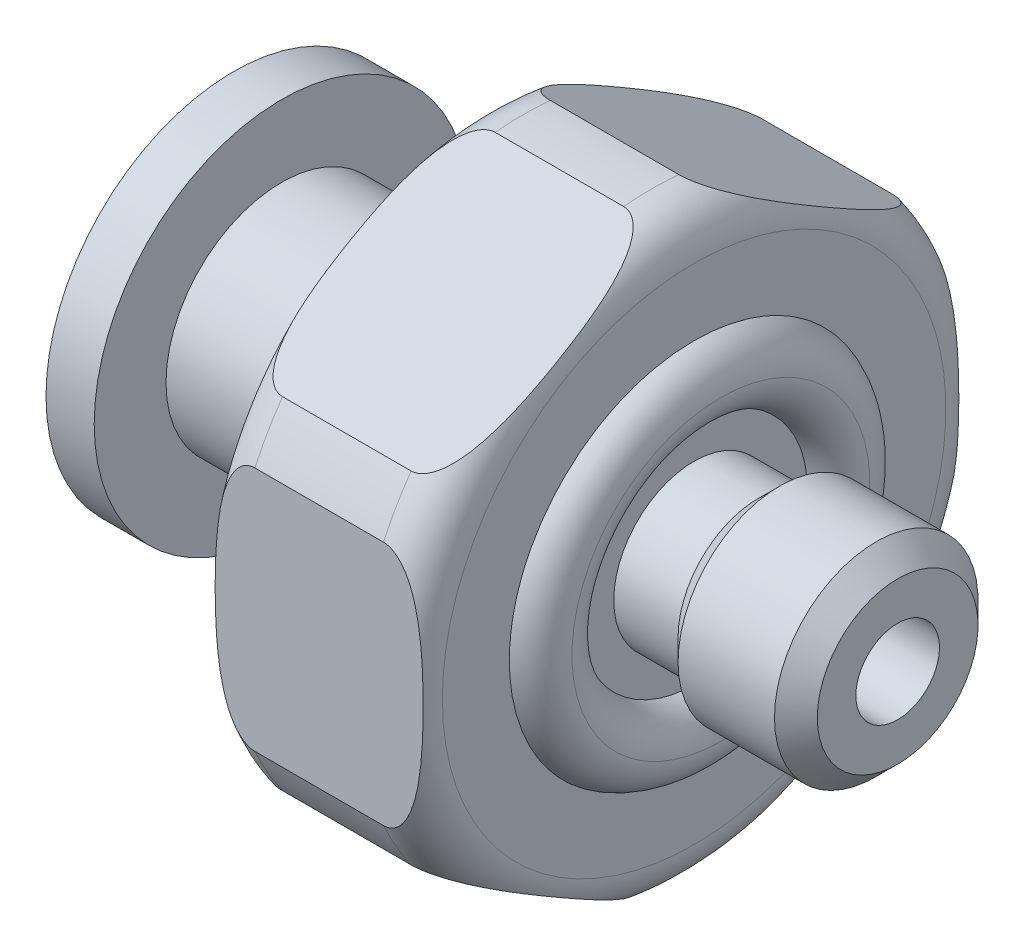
ISO-10303-21;
HEADER;
FILE_DESCRIPTION(('STEP AP214'),'2;1');
FILE_NAME('part.step','',(''),(''),'','','');
FILE_SCHEMA(('AUTOMOTIVE_DESIGN { 1 0 10303 214 1 1 1 1 }'));
ENDSEC;
DATA;
#1=APPLICATION_CONTEXT('core data for automotive mechanical design processes');
#2=APPLICATION_PROTOCOL_DEFINITION('international standard','automotive_design',2000,#1);
#3=PRODUCT_CONTEXT('',#1,'mechanical');
#4=PRODUCT('Part','Part','',(#3));
#5=PRODUCT_RELATED_PRODUCT_CATEGORY('part','',(#4));
#6=PRODUCT_DEFINITION_FORMATION('','',#4);
#7=PRODUCT_DEFINITION_CONTEXT('part definition',#1,'design');
#8=PRODUCT_DEFINITION('design','',#6,#7);
#9=PRODUCT_DEFINITION_SHAPE('','',#8);
#10=(LENGTH_UNIT() NAMED_UNIT(*) SI_UNIT(.MILLI.,.METRE.));
#11=(NAMED_UNIT(*) PLANE_ANGLE_UNIT() SI_UNIT($,.RADIAN.));
#12=(NAMED_UNIT(*) SI_UNIT($,.STERADIAN.) SOLID_ANGLE_UNIT());
#13=UNCERTAINTY_MEASURE_WITH_UNIT(LENGTH_MEASURE(1.E-05),#10,'distance_accuracy_value','');
#14=(GEOMETRIC_REPRESENTATION_CONTEXT(3) GLOBAL_UNCERTAINTY_ASSIGNED_CONTEXT((#13)) GLOBAL_UNIT_ASSIGNED_CONTEXT((#10,
#11,#12)) REPRESENTATION_CONTEXT('',''));
#15=CARTESIAN_POINT('',(0.,0.,0.));
#16=DIRECTION('',(0.,0.,1.));
#17=DIRECTION('',(1.,0.,0.));
#18=AXIS2_PLACEMENT_3D('',#15,#16,#17);
#19=CARTESIAN_POINT('',(0.,0.,0.));
#20=DIRECTION('',(-1.,0.,0.));
#21=DIRECTION('',(0.,0.,1.));
#22=AXIS2_PLACEMENT_3D('',#19,#20,#21);
#23=CYLINDRICAL_SURFACE('',#22,6.985);
#24=CARTESIAN_POINT('',(9.906,0.,0.));
#25=DIRECTION('',(-1.,0.,0.));
#26=DIRECTION('',(0.,0.,1.));
#27=AXIS2_PLACEMENT_3D('',#24,#25,#26);
#28=CIRCLE('',#27,6.985);
#29=CARTESIAN_POINT('',(9.906,6.95422909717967,0.654921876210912));
#30=VERTEX_POINT('',#29);
#31=CARTESIAN_POINT('',(9.906,6.95422909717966,-0.654921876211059));
#32=VERTEX_POINT('',#31);
#33=EDGE_CURVE('P0_E120',#30,#32,#28,.T.);
#34=ORIENTED_EDGE('',*,*,#33,.T.);
#35=DIRECTION('',(-1.,0.,0.));
#36=VECTOR('',#35,1.);
#37=CARTESIAN_POINT('',(0.,6.95422909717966,-0.654921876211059));
#38=LINE('',#37,#36);
#39=CARTESIAN_POINT('',(6.85800000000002,6.95422909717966,-0.654921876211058));
#40=VERTEX_POINT('',#39);
#41=EDGE_CURVE('P0_E110',#32,#40,#38,.T.);
#42=ORIENTED_EDGE('',*,*,#41,.T.);
#43=CARTESIAN_POINT('',(6.858,0.,0.));
#44=DIRECTION('',(-1.,0.,0.));
#45=DIRECTION('',(0.,0.,1.));
#46=AXIS2_PLACEMENT_3D('',#43,#44,#45);
#47=CIRCLE('',#46,6.985);
#48=CARTESIAN_POINT('',(6.858,6.95422909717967,0.654921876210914));
#49=VERTEX_POINT('',#48);
#50=EDGE_CURVE('P0_E118',#49,#40,#47,.T.);
#51=ORIENTED_EDGE('',*,*,#50,.F.);
#52=DIRECTION('',(-1.,0.,0.));
#53=VECTOR('',#52,1.);
#54=CARTESIAN_POINT('',(0.,6.95422909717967,0.654921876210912));
#55=LINE('',#54,#53);
#56=EDGE_CURVE('P0_E45',#49,#30,#55,.F.);
#57=ORIENTED_EDGE('',*,*,#56,.T.);
#58=EDGE_LOOP('',(#34,#42,#51,#57));
#59=FACE_BOUND('',#58,.T.);
#60=ADVANCED_FACE('P0_F16',(#59),#23,.T.);
#61=CARTESIAN_POINT('',(9.906,2.90993556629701,6.34999999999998));
#62=VERTEX_POINT('',#61);
#63=CARTESIAN_POINT('',(9.906,4.04429353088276,5.69507812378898));
#64=VERTEX_POINT('',#63);
#65=EDGE_CURVE('P0_E399',#62,#64,#28,.T.);
#66=ORIENTED_EDGE('',*,*,#65,.T.);
#67=DIRECTION('',(-1.,0.,0.));
#68=VECTOR('',#67,1.);
#69=CARTESIAN_POINT('',(0.,4.04429353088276,5.69507812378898));
#70=LINE('',#69,#68);
#71=CARTESIAN_POINT('',(6.85800000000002,4.04429353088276,5.69507812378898));
#72=VERTEX_POINT('',#71);
#73=EDGE_CURVE('P0_E266',#64,#72,#70,.T.);
#74=ORIENTED_EDGE('',*,*,#73,.T.);
#75=CARTESIAN_POINT('',(6.858,2.909935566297,6.34999999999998));
#76=VERTEX_POINT('',#75);
#77=EDGE_CURVE('P0_E127',#76,#72,#47,.T.);
#78=ORIENTED_EDGE('',*,*,#77,.F.);
#79=DIRECTION('',(-1.,0.,0.));
#80=VECTOR('',#79,1.);
#81=CARTESIAN_POINT('',(0.,2.90993556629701,6.34999999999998));
#82=LINE('',#81,#80);
#83=EDGE_CURVE('P0_E265',#76,#62,#82,.F.);
#84=ORIENTED_EDGE('',*,*,#83,.T.);
#85=EDGE_LOOP('',(#66,#74,#78,#84));
#86=FACE_BOUND('',#85,.T.);
#87=ADVANCED_FACE('P0_F309',(#86),#23,.T.);
#88=CARTESIAN_POINT('',(9.906,-4.04429353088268,5.69507812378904));
#89=VERTEX_POINT('',#88);
#90=CARTESIAN_POINT('',(9.906,-2.90993556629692,6.35000000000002));
#91=VERTEX_POINT('',#90);
#92=EDGE_CURVE('P0_E401',#89,#91,#28,.T.);
#93=ORIENTED_EDGE('',*,*,#92,.T.);
#94=DIRECTION('',(-1.,0.,0.));
#95=VECTOR('',#94,1.);
#96=CARTESIAN_POINT('',(0.,-2.90993556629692,6.35000000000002));
#97=LINE('',#96,#95);
#98=CARTESIAN_POINT('',(6.858,-2.90993556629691,6.35000000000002));
#99=VERTEX_POINT('',#98);
#100=EDGE_CURVE('P0_E384',#91,#99,#97,.T.);
#101=ORIENTED_EDGE('',*,*,#100,.T.);
#102=CARTESIAN_POINT('',(6.858,-4.04429353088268,5.69507812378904));
#103=VERTEX_POINT('',#102);
#104=EDGE_CURVE('P0_E135',#103,#99,#47,.T.);
#105=ORIENTED_EDGE('',*,*,#104,.F.);
#106=DIRECTION('',(-1.,0.,0.));
#107=VECTOR('',#106,1.);
#108=CARTESIAN_POINT('',(0.,-4.04429353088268,5.69507812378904));
#109=LINE('',#108,#107);
#110=EDGE_CURVE('P0_E371',#103,#89,#109,.F.);
#111=ORIENTED_EDGE('',*,*,#110,.T.);
#112=EDGE_LOOP('',(#93,#101,#105,#111));
#113=FACE_BOUND('',#112,.T.);
#114=ADVANCED_FACE('P0_F314',(#113),#23,.T.);
#115=CARTESIAN_POINT('',(9.906,-6.95422909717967,-0.654921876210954));
#116=VERTEX_POINT('',#115);
#117=CARTESIAN_POINT('',(9.906,-6.95422909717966,0.654921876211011));
#118=VERTEX_POINT('',#117);
#119=EDGE_CURVE('P0_E150',#116,#118,#28,.T.);
#120=ORIENTED_EDGE('',*,*,#119,.T.);
#121=DIRECTION('',(-1.,0.,0.));
#122=VECTOR('',#121,1.);
#123=CARTESIAN_POINT('',(0.,-6.95422909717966,0.654921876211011));
#124=LINE('',#123,#122);
#125=CARTESIAN_POINT('',(6.85800000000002,-6.95422909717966,0.654921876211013));
#126=VERTEX_POINT('',#125);
#127=EDGE_CURVE('P0_E364',#118,#126,#124,.T.);
#128=ORIENTED_EDGE('',*,*,#127,.T.);
#129=CARTESIAN_POINT('',(6.858,-6.95422909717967,-0.65492187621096));
#130=VERTEX_POINT('',#129);
#131=EDGE_CURVE('P0_E143',#130,#126,#47,.T.);
#132=ORIENTED_EDGE('',*,*,#131,.F.);
#133=DIRECTION('',(-1.,0.,0.));
#134=VECTOR('',#133,1.);
#135=CARTESIAN_POINT('',(0.,-6.95422909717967,-0.654921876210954));
#136=LINE('',#135,#134);
#137=EDGE_CURVE('P0_E354',#130,#116,#136,.F.);
#138=ORIENTED_EDGE('',*,*,#137,.T.);
#139=EDGE_LOOP('',(#120,#128,#132,#138));
#140=FACE_BOUND('',#139,.T.);
#141=ADVANCED_FACE('P0_F326',(#140),#23,.T.);
#142=CARTESIAN_POINT('',(9.906,-2.90993556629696,-6.35));
#143=VERTEX_POINT('',#142);
#144=CARTESIAN_POINT('',(9.906,-4.04429353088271,-5.69507812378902));
#145=VERTEX_POINT('',#144);
#146=EDGE_CURVE('P0_E145',#143,#145,#28,.T.);
#147=ORIENTED_EDGE('',*,*,#146,.T.);
#148=DIRECTION('',(-1.,0.,0.));
#149=VECTOR('',#148,1.);
#150=CARTESIAN_POINT('',(0.,-4.04429353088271,-5.69507812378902));
#151=LINE('',#150,#149);
#152=CARTESIAN_POINT('',(6.85800000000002,-4.04429353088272,-5.69507812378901));
#153=VERTEX_POINT('',#152);
#154=EDGE_CURVE('P0_E339',#145,#153,#151,.T.);
#155=ORIENTED_EDGE('',*,*,#154,.T.);
#156=CARTESIAN_POINT('',(6.858,-2.90993556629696,-6.35));
#157=VERTEX_POINT('',#156);
#158=EDGE_CURVE('P0_E138',#157,#153,#47,.T.);
#159=ORIENTED_EDGE('',*,*,#158,.F.);
#160=DIRECTION('',(-1.,0.,0.));
#161=VECTOR('',#160,1.);
#162=CARTESIAN_POINT('',(0.,-2.90993556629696,-6.35));
#163=LINE('',#162,#161);
#164=EDGE_CURVE('P0_E340',#157,#143,#163,.F.);
#165=ORIENTED_EDGE('',*,*,#164,.T.);
#166=EDGE_LOOP('',(#147,#155,#159,#165));
#167=FACE_BOUND('',#166,.T.);
#168=ADVANCED_FACE('P0_F318',(#167),#23,.T.);
#169=CARTESIAN_POINT('',(10.922,5.969,0.));
#170=DIRECTION('',(-1.,0.,0.));
#171=DIRECTION('',(0.,0.,1.));
#172=AXIS2_PLACEMENT_3D('',#169,#170,#171);
#173=PLANE('',#172);
#174=CARTESIAN_POINT('',(10.922,0.,0.));
#175=DIRECTION('',(-1.,0.,0.));
#176=DIRECTION('',(0.,0.,1.));
#177=AXIS2_PLACEMENT_3D('',#174,#175,#176);
#178=CIRCLE('',#177,5.969);
#179=CARTESIAN_POINT('',(10.922,0.,5.969));
#180=VERTEX_POINT('',#179);
#181=EDGE_CURVE('P0_E149',#180,#180,#178,.T.);
#182=ORIENTED_EDGE('',*,*,#181,.F.);
#183=EDGE_LOOP('',(#182));
#184=FACE_BOUND('',#183,.T.);
#185=CARTESIAN_POINT('',(10.922,0.,0.));
#186=DIRECTION('',(-1.,0.,0.));
#187=DIRECTION('',(0.,0.,1.));
#188=AXIS2_PLACEMENT_3D('',#185,#186,#187);
#189=CIRCLE('',#188,1.905);
#190=CARTESIAN_POINT('',(10.922,0.,1.905));
#191=VERTEX_POINT('',#190);
#192=EDGE_CURVE('P0_E154',#191,#191,#189,.T.);
#193=ORIENTED_EDGE('',*,*,#192,.T.);
#194=EDGE_LOOP('',(#193));
#195=FACE_BOUND('',#194,.T.);
#196=ADVANCED_FACE('P0_F222',(#184,#195),#173,.F.);
#197=CARTESIAN_POINT('',(9.906,0.,0.));
#198=DIRECTION('',(-1.,0.,0.));
#199=DIRECTION('',(0.,0.,1.));
#200=AXIS2_PLACEMENT_3D('',#197,#198,#199);
#201=TOROIDAL_SURFACE('',#200,5.969,1.016);
#202=CARTESIAN_POINT('',(9.906,4.04429353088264,-5.69507812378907));
#203=VERTEX_POINT('',#202);
#204=CARTESIAN_POINT('',(9.906,2.90993556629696,-6.35));
#205=VERTEX_POINT('',#204);
#206=EDGE_CURVE('P0_E142',#203,#205,#28,.T.);
#207=ORIENTED_EDGE('',*,*,#206,.F.);
#208=CARTESIAN_POINT('',(9.9058,4.04429355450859,-5.69507808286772));
#209=CARTESIAN_POINT('',(9.9316326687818,4.04425462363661,-5.69514551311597));
#210=CARTESIAN_POINT('',(9.9573925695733,4.04546187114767,-5.6930544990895));
#211=CARTESIAN_POINT('',(10.0078715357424,4.05007898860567,-5.68505741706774));
#212=CARTESIAN_POINT('',(10.0325981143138,4.05346802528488,-5.67918743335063));
#213=CARTESIAN_POINT('',(10.0805477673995,4.06215433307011,-5.66414230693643));
#214=CARTESIAN_POINT('',(10.1037754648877,4.06744536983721,-5.6549779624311));
#215=CARTESIAN_POINT('',(10.1485834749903,4.0795851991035,-5.63395116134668));
#216=CARTESIAN_POINT('',(10.1701594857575,4.08643788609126,-5.62208195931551));
#217=CARTESIAN_POINT('',(10.2264021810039,4.10672825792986,-5.58693800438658));
#218=CARTESIAN_POINT('',(10.2593404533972,4.12136041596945,-5.56159436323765));
#219=CARTESIAN_POINT('',(10.3203937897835,4.1529471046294,-5.50688461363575));
#220=CARTESIAN_POINT('',(10.3484948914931,4.1699081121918,-5.47750728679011));
#221=CARTESIAN_POINT('',(10.3982793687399,4.20379274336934,-5.41881738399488));
#222=CARTESIAN_POINT('',(10.4203081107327,4.22059177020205,-5.38972061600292));
#223=CARTESIAN_POINT('',(10.4614324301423,4.25507356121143,-5.32999640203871));
#224=CARTESIAN_POINT('',(10.4805253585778,4.27275710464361,-5.29936760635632));
#225=CARTESIAN_POINT('',(10.5162338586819,4.3087751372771,-5.23698254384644));
#226=CARTESIAN_POINT('',(10.5328445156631,4.32711083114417,-5.20522419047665));
#227=CARTESIAN_POINT('',(10.5639018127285,4.36422129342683,-5.14094698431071));
#228=CARTESIAN_POINT('',(10.5783493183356,4.38299588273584,-5.10842844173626));
#229=CARTESIAN_POINT('',(10.612579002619,4.43093402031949,-5.02539715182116));
#230=CARTESIAN_POINT('',(10.6311187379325,4.4603189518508,-4.97450095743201));
#231=CARTESIAN_POINT('',(10.6647123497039,4.51958787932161,-4.87184416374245));
#232=CARTESIAN_POINT('',(10.6797642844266,4.54947214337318,-4.82008310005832));
#233=CARTESIAN_POINT('',(10.7207302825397,4.63971080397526,-4.66378515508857));
#234=CARTESIAN_POINT('',(10.742385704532,4.70054616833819,-4.558415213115));
#235=CARTESIAN_POINT('',(10.7780631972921,4.82300818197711,-4.34630478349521));
#236=CARTESIAN_POINT('',(10.7920499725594,4.88463717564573,-4.23956023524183));
#237=CARTESIAN_POINT('',(10.8145428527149,5.00807307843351,-4.02576298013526));
#238=CARTESIAN_POINT('',(10.8230545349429,5.06987974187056,-3.91871069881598));
#239=CARTESIAN_POINT('',(10.8348069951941,5.18140417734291,-3.72554471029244));
#240=CARTESIAN_POINT('',(10.8387558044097,5.23110485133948,-3.63946061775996));
#241=CARTESIAN_POINT('',(10.8445344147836,5.33054563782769,-3.46722412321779));
#242=CARTESIAN_POINT('',(10.8463638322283,5.38028575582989,-3.3810717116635));
#243=CARTESIAN_POINT('',(10.8481236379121,5.47960781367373,-3.20904086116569));
#244=CARTESIAN_POINT('',(10.8480603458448,5.52918972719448,-3.12316246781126));
#245=CARTESIAN_POINT('',(10.8460387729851,5.62834037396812,-2.95142850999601));
#246=CARTESIAN_POINT('',(10.8440806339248,5.67790910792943,-2.86557294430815));
#247=CARTESIAN_POINT('',(10.83689736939,5.79590448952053,-2.6611989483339));
#248=CARTESIAN_POINT('',(10.8307114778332,5.8643174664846,-2.54270419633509));
#249=CARTESIAN_POINT('',(10.8129485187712,6.0010907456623,-2.30580592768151));
#250=CARTESIAN_POINT('',(10.8013633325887,6.06945081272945,-2.18740281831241));
#251=CARTESIAN_POINT('',(10.7779001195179,6.172475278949,-2.00895920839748));
#252=CARTESIAN_POINT('',(10.7689239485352,6.20730360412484,-1.9486347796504));
#253=CARTESIAN_POINT('',(10.7484213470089,6.27676992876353,-1.82831557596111));
#254=CARTESIAN_POINT('',(10.7368953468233,6.31140795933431,-1.76832074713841));
#255=CARTESIAN_POINT('',(10.7107062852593,6.38034714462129,-1.64891457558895));
#256=CARTESIAN_POINT('',(10.6960471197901,6.41464866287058,-1.58950260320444));
#257=CARTESIAN_POINT('',(10.6627991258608,6.48276535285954,-1.47152103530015));
#258=CARTESIAN_POINT('',(10.6442122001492,6.51658075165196,-1.41295104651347));
#259=CARTESIAN_POINT('',(10.6015650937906,6.58421245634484,-1.2958094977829));
#260=CARTESIAN_POINT('',(10.5773883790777,6.618010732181,-1.23726916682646));
#261=CARTESIAN_POINT('',(10.5222351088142,6.6842559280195,-1.12252912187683));
#262=CARTESIAN_POINT('',(10.4912578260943,6.71670270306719,-1.06632965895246));
#263=CARTESIAN_POINT('',(10.4297655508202,6.77075524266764,-0.972707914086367));
#264=CARTESIAN_POINT('',(10.4013293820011,6.79294491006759,-0.934274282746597));
#265=CARTESIAN_POINT('',(10.3384599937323,6.83510725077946,-0.861246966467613));
#266=CARTESIAN_POINT('',(10.3040419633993,6.85508533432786,-0.826643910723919));
#267=CARTESIAN_POINT('',(10.2430766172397,6.88416907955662,-0.776269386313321));
#268=CARTESIAN_POINT('',(10.2187912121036,6.89445207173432,-0.758458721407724));
#269=CARTESIAN_POINT('',(10.167455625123,6.91314055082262,-0.726089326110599));
#270=CARTESIAN_POINT('',(10.1404086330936,6.92154816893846,-0.711526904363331));
#271=CARTESIAN_POINT('',(10.0890357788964,6.93450989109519,-0.689076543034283));
#272=CARTESIAN_POINT('',(10.0651443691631,6.939490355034,-0.680450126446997));
#273=CARTESIAN_POINT('',(10.0160672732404,6.94740336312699,-0.666744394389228));
#274=CARTESIAN_POINT('',(9.99088482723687,6.95034078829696,-0.661656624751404));
#275=CARTESIAN_POINT('',(9.94565783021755,6.95353742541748,-0.656119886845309));
#276=CARTESIAN_POINT('',(9.92573742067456,6.95425168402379,-0.654882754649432));
#277=CARTESIAN_POINT('',(9.90580000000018,6.95422907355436,-0.654921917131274));
#278=B_SPLINE_CURVE_WITH_KNOTS('',3,(#208,#209,#210,#211,#212,#213,#214,#215,#216,#217,#218,
#219,#220,#221,#222,#223,#224,#225,#226,#227,#228,#229,#230,#231,#232,#233,#234,#235,#236,#237,
#238,#239,#240,#241,#242,#243,#244,#245,#246,#247,#248,#249,#250,#251,#252,#253,#254,#255,#256,
#257,#258,#259,#260,#261,#262,#263,#264,#265,#266,#267,#268,#269,#270,#271,#272,#273,#274,#275,
#276,#277),.UNSPECIFIED.,.F.,.F.,(4,2,2,2,2,2,2,2,2,2,2,2,2,2,2,2,2,2,2,2,2,2,2,2,2,2,2,2,2,2,2,
2,2,2,4),(0.,0.0772668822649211,0.153806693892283,0.230097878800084,0.30658144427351,
0.437999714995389,0.569791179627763,0.690140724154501,0.81059823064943,0.931291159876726,
1.05193566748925,1.23666074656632,1.42148842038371,1.79180312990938,2.1638082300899,
2.5354337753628,2.83385045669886,3.132321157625,3.4297953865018,3.72724736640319,
4.13807710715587,4.5495265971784,4.7601884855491,4.9708148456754,5.18118081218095,
5.39144510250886,5.60656741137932,5.82171273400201,5.97949572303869,6.13688377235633,
6.23209727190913,6.32720201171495,6.40455439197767,6.48172132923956,6.54145982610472),.UNSPECIFIED.);
#279=EDGE_CURVE('P0_E122',#203,#32,#278,.T.);
#280=ORIENTED_EDGE('',*,*,#279,.T.);
#281=ORIENTED_EDGE('',*,*,#33,.F.);
#282=CARTESIAN_POINT('',(9.9058,6.95422907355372,0.654921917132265));
#283=CARTESIAN_POINT('',(9.9316326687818,6.9542680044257,0.654854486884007));
#284=CARTESIAN_POINT('',(9.9573925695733,6.95306075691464,0.656945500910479));
#285=CARTESIAN_POINT('',(10.0078715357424,6.94844363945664,0.664942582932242));
#286=CARTESIAN_POINT('',(10.0325981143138,6.94505460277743,0.670812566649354));
#287=CARTESIAN_POINT('',(10.0805477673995,6.93636829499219,0.685857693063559));
#288=CARTESIAN_POINT('',(10.1037754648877,6.9310772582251,0.695022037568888));
#289=CARTESIAN_POINT('',(10.1485834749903,6.91893742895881,0.716048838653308));
#290=CARTESIAN_POINT('',(10.1701594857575,6.91208474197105,0.727918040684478));
#291=CARTESIAN_POINT('',(10.2264021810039,6.89179437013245,0.763061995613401));
#292=CARTESIAN_POINT('',(10.2593404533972,6.87716221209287,0.788405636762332));
#293=CARTESIAN_POINT('',(10.3203937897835,6.84557552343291,0.84311538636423));
#294=CARTESIAN_POINT('',(10.3484948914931,6.82861451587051,0.872492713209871));
#295=CARTESIAN_POINT('',(10.3982793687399,6.79472988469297,0.931182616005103));
#296=CARTESIAN_POINT('',(10.4203081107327,6.77793085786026,0.960279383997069));
#297=CARTESIAN_POINT('',(10.4614324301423,6.74344906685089,1.02000359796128));
#298=CARTESIAN_POINT('',(10.4805253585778,6.72576552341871,1.05063239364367));
#299=CARTESIAN_POINT('',(10.5162338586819,6.68974749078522,1.11301745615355));
#300=CARTESIAN_POINT('',(10.5328445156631,6.67141179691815,1.14477580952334));
#301=CARTESIAN_POINT('',(10.5639018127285,6.63430133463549,1.20905301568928));
#302=CARTESIAN_POINT('',(10.5783493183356,6.61552674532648,1.24157155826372));
#303=CARTESIAN_POINT('',(10.612579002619,6.56758860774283,1.32460284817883));
#304=CARTESIAN_POINT('',(10.6311187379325,6.53820367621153,1.37549904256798));
#305=CARTESIAN_POINT('',(10.6647123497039,6.47893474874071,1.47815583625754));
#306=CARTESIAN_POINT('',(10.6797642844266,6.44905048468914,1.52991689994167));
#307=CARTESIAN_POINT('',(10.7207302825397,6.35881182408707,1.68621484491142));
#308=CARTESIAN_POINT('',(10.742385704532,6.29797645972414,1.79158478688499));
#309=CARTESIAN_POINT('',(10.7780631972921,6.17551444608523,2.00369521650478));
#310=CARTESIAN_POINT('',(10.7920499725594,6.11388545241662,2.11043976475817));
#311=CARTESIAN_POINT('',(10.8145428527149,5.99044954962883,2.32423701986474));
#312=CARTESIAN_POINT('',(10.8230545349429,5.92864288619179,2.43128930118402));
#313=CARTESIAN_POINT('',(10.8348069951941,5.81711845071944,2.62445528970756));
#314=CARTESIAN_POINT('',(10.8387558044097,5.76741777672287,2.71053938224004));
#315=CARTESIAN_POINT('',(10.8445344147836,5.66797699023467,2.88277587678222));
#316=CARTESIAN_POINT('',(10.8463638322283,5.61823687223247,2.9689282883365));
#317=CARTESIAN_POINT('',(10.8481236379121,5.51891481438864,3.14095913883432));
#318=CARTESIAN_POINT('',(10.8480603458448,5.46933290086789,3.22683753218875));
#319=CARTESIAN_POINT('',(10.8460387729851,5.37018225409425,3.398571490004));
#320=CARTESIAN_POINT('',(10.8440806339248,5.32061352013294,3.48442705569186));
#321=CARTESIAN_POINT('',(10.83689736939,5.20261813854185,3.68880105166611));
#322=CARTESIAN_POINT('',(10.8307114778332,5.13420516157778,3.80729580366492));
#323=CARTESIAN_POINT('',(10.8129485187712,4.99743188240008,4.0441940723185));
#324=CARTESIAN_POINT('',(10.8013633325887,4.92907181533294,4.1625971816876));
#325=CARTESIAN_POINT('',(10.7779001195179,4.82604734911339,4.34104079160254));
#326=CARTESIAN_POINT('',(10.7689239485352,4.79121902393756,4.40136522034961));
#327=CARTESIAN_POINT('',(10.7484213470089,4.72175269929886,4.5216844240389));
#328=CARTESIAN_POINT('',(10.7368953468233,4.68711466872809,4.58167925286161));
#329=CARTESIAN_POINT('',(10.7107062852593,4.61817548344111,4.70108542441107));
#330=CARTESIAN_POINT('',(10.6960471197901,4.58387396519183,4.76049739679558));
#331=CARTESIAN_POINT('',(10.6627991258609,4.51575727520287,4.87847896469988));
#332=CARTESIAN_POINT('',(10.6442122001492,4.48194187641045,4.93704895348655));
#333=CARTESIAN_POINT('',(10.6015650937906,4.41431017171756,5.05419050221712));
#334=CARTESIAN_POINT('',(10.5773883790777,4.38051189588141,5.11273083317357));
#335=CARTESIAN_POINT('',(10.5222351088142,4.31426670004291,5.22747087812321));
#336=CARTESIAN_POINT('',(10.4912578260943,4.28181992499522,5.28367034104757));
#337=CARTESIAN_POINT('',(10.4297655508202,4.22776738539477,5.37729208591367));
#338=CARTESIAN_POINT('',(10.4013293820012,4.20557771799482,5.41572571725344));
#339=CARTESIAN_POINT('',(10.3384599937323,4.16341537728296,5.48875303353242));
#340=CARTESIAN_POINT('',(10.3040419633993,4.14343729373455,5.52335608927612));
#341=CARTESIAN_POINT('',(10.2430766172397,4.11435354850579,5.57373061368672));
#342=CARTESIAN_POINT('',(10.2187912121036,4.1040705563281,5.59154127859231));
#343=CARTESIAN_POINT('',(10.167455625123,4.0853820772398,5.62391067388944));
#344=CARTESIAN_POINT('',(10.1404086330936,4.07697445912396,5.63847309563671));
#345=CARTESIAN_POINT('',(10.0890357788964,4.06401273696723,5.66092345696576));
#346=CARTESIAN_POINT('',(10.0651443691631,4.05903227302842,5.66954987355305));
#347=CARTESIAN_POINT('',(10.0160672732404,4.05111926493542,5.68325560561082));
#348=CARTESIAN_POINT('',(9.99088482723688,4.04818183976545,5.68834337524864));
#349=CARTESIAN_POINT('',(9.94565783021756,4.04498520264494,5.69388011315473));
#350=CARTESIAN_POINT('',(9.92573742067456,4.04427094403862,5.69511724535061));
#351=CARTESIAN_POINT('',(9.90580000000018,4.04429355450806,5.69507808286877));
#352=B_SPLINE_CURVE_WITH_KNOTS('',3,(#282,#283,#284,#285,#286,#287,#288,#289,#290,#291,#292,
#293,#294,#295,#296,#297,#298,#299,#300,#301,#302,#303,#304,#305,#306,#307,#308,#309,#310,#311,
#312,#313,#314,#315,#316,#317,#318,#319,#320,#321,#322,#323,#324,#325,#326,#327,#328,#329,#330,
#331,#332,#333,#334,#335,#336,#337,#338,#339,#340,#341,#342,#343,#344,#345,#346,#347,#348,#349,
#350,#351),.UNSPECIFIED.,.F.,.F.,(4,2,2,2,2,2,2,2,2,2,2,2,2,2,2,2,2,2,2,2,2,2,2,2,2,2,2,2,2,2,2,
2,2,2,4),(0.,0.077266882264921,0.153806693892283,0.230097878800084,0.30658144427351,
0.437999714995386,0.569791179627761,0.690140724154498,0.810598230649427,0.931291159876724,
1.05193566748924,1.23666074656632,1.42148842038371,1.79180312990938,2.1638082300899,
2.5354337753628,2.83385045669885,3.13232115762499,3.42979538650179,3.72724736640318,
4.13807710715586,4.54952659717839,4.76018848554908,4.97081484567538,5.18118081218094,
5.39144510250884,5.60656741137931,5.82171273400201,5.97949572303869,6.13688377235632,
6.23209727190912,6.32720201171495,6.40455439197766,6.48172132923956,6.54145982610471),.UNSPECIFIED.);
#353=EDGE_CURVE('P0_E255',#30,#64,#352,.T.);
#354=ORIENTED_EDGE('',*,*,#353,.T.);
#355=ORIENTED_EDGE('',*,*,#65,.F.);
#356=CARTESIAN_POINT('',(10.8478572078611,0.,6.35));
#357=CARTESIAN_POINT('',(10.8478556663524,-0.0856202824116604,6.35));
#358=CARTESIAN_POINT('',(10.8471615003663,-0.171239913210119,6.35));
#359=CARTESIAN_POINT('',(10.8443186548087,-0.342455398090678,6.35));
#360=CARTESIAN_POINT('',(10.8421699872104,-0.428051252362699,6.35));
#361=CARTESIAN_POINT('',(10.8362260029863,-0.59930922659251,6.35));
#362=CARTESIAN_POINT('',(10.8324283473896,-0.684971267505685,6.35));
#363=CARTESIAN_POINT('',(10.8228597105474,-0.856184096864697,6.35000000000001));
#364=CARTESIAN_POINT('',(10.8170888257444,-0.941734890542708,6.35000000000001));
#365=CARTESIAN_POINT('',(10.8031464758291,-1.11202975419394,6.35000000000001));
#366=CARTESIAN_POINT('',(10.7949924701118,-1.19677521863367,6.35000000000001));
#367=CARTESIAN_POINT('',(10.7756274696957,-1.36591377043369,6.35000000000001));
#368=CARTESIAN_POINT('',(10.7644169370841,-1.45030690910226,6.35000000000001));
#369=CARTESIAN_POINT('',(10.7381021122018,-1.61828938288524,6.35000000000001));
#370=CARTESIAN_POINT('',(10.7230071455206,-1.70188015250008,6.35000000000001));
#371=CARTESIAN_POINT('',(10.6877534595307,-1.86797062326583,6.35000000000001));
#372=CARTESIAN_POINT('',(10.6675985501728,-1.95047109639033,6.35000000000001));
#373=CARTESIAN_POINT('',(10.6353063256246,-2.0624598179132,6.35000000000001));
#374=CARTESIAN_POINT('',(10.6260549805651,-2.09278402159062,6.35000000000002));
#375=CARTESIAN_POINT('',(10.6064967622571,-2.15309372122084,6.35000000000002));
#376=CARTESIAN_POINT('',(10.5961897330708,-2.18307916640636,6.35000000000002));
#377=CARTESIAN_POINT('',(10.5634557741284,-2.27252642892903,6.35000000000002));
#378=CARTESIAN_POINT('',(10.5392485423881,-2.3313623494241,6.35000000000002));
#379=CARTESIAN_POINT('',(10.4845845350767,-2.44676016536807,6.35000000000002));
#380=CARTESIAN_POINT('',(10.4540725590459,-2.5032963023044,6.35000000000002));
#381=CARTESIAN_POINT('',(10.3851730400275,-2.61134777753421,6.35000000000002));
#382=CARTESIAN_POINT('',(10.3468165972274,-2.66288179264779,6.35000000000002));
#383=CARTESIAN_POINT('',(10.2820892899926,-2.73295861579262,6.35000000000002));
#384=CARTESIAN_POINT('',(10.2595035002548,-2.75497956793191,6.35000000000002));
#385=CARTESIAN_POINT('',(10.2116452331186,-2.79596074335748,6.35000000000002));
#386=CARTESIAN_POINT('',(10.1863719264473,-2.81492001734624,6.35000000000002));
#387=CARTESIAN_POINT('',(10.1327698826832,-2.84886030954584,6.35000000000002));
#388=CARTESIAN_POINT('',(10.1044063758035,-2.86378766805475,6.35000000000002));
#389=CARTESIAN_POINT('',(10.0453348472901,-2.88790611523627,6.35000000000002));
#390=CARTESIAN_POINT('',(10.0146321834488,-2.89710989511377,6.35000000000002));
#391=CARTESIAN_POINT('',(9.95539169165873,-2.90798102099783,6.35000000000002));
#392=CARTESIAN_POINT('',(9.92698744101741,-2.91036625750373,6.35000000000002));
#393=CARTESIAN_POINT('',(9.8702794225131,-2.90937666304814,6.35000000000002));
#394=CARTESIAN_POINT('',(9.84197564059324,-2.90600267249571,6.35000000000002));
#395=CARTESIAN_POINT('',(9.79077709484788,-2.89483833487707,6.35000000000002));
#396=CARTESIAN_POINT('',(9.76771253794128,-2.88779457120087,6.35000000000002));
#397=CARTESIAN_POINT('',(9.72288065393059,-2.87040412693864,6.35000000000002));
#398=CARTESIAN_POINT('',(9.70111363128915,-2.86005667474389,6.35000000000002));
#399=CARTESIAN_POINT('',(9.6477624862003,-2.83033062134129,6.35000000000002));
#400=CARTESIAN_POINT('',(9.61721773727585,-2.80909147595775,6.35000000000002));
#401=CARTESIAN_POINT('',(9.55981979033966,-2.76210462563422,6.35000000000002));
#402=CARTESIAN_POINT('',(9.53297724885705,-2.73634437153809,6.35000000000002));
#403=CARTESIAN_POINT('',(9.46526718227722,-2.66285804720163,6.35000000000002));
#404=CARTESIAN_POINT('',(9.42754218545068,-2.61226367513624,6.35000000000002));
#405=CARTESIAN_POINT('',(9.35971146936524,-2.50629260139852,6.35000000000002));
#406=CARTESIAN_POINT('',(9.32962374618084,-2.45090500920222,6.35000000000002));
#407=CARTESIAN_POINT('',(9.26693738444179,-2.31971233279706,6.35000000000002));
#408=CARTESIAN_POINT('',(9.23646057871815,-2.24290816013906,6.35000000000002));
#409=CARTESIAN_POINT('',(9.1829125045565,-2.08671071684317,6.35000000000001));
#410=CARTESIAN_POINT('',(9.15985596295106,-2.00731263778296,6.35000000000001));
#411=CARTESIAN_POINT('',(9.11926201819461,-1.84669884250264,6.35000000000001));
#412=CARTESIAN_POINT('',(9.10175459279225,-1.76547570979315,6.35000000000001));
#413=CARTESIAN_POINT('',(9.07111509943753,-1.60230571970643,6.35000000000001));
#414=CARTESIAN_POINT('',(9.057979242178,-1.52035955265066,6.35000000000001));
#415=CARTESIAN_POINT('',(9.03353344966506,-1.34481725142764,6.35000000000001));
#416=CARTESIAN_POINT('',(9.02271561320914,-1.25115400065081,6.35000000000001));
#417=CARTESIAN_POINT('',(9.00440827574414,-1.06349540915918,6.35000000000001));
#418=CARTESIAN_POINT('',(8.99691946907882,-0.969500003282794,6.35000000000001));
#419=CARTESIAN_POINT('',(8.98453069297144,-0.781249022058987,6.35));
#420=CARTESIAN_POINT('',(8.9796333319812,-0.686993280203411,6.35));
#421=CARTESIAN_POINT('',(8.97193462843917,-0.498392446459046,6.35));
#422=CARTESIAN_POINT('',(8.96913343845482,-0.40404734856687,6.35));
#423=CARTESIAN_POINT('',(8.96532986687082,-0.21538400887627,6.35));
#424=CARTESIAN_POINT('',(8.96432630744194,-0.121065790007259,6.35));
#425=CARTESIAN_POINT('',(8.96400485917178,0.0675689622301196,6.35));
#426=CARTESIAN_POINT('',(8.96468689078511,0.161885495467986,6.35));
#427=CARTESIAN_POINT('',(8.96781000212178,0.350425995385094,6.35));
#428=CARTESIAN_POINT('',(8.97024987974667,0.444649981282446,6.35));
#429=CARTESIAN_POINT('',(8.97714844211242,0.633020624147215,6.35));
#430=CARTESIAN_POINT('',(8.98160699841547,0.72716728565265,6.35));
#431=CARTESIAN_POINT('',(8.99300112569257,0.915270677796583,6.34999999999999));
#432=CARTESIAN_POINT('',(8.99993552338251,1.00922747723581,6.34999999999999));
#433=CARTESIAN_POINT('',(9.01697115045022,1.19689429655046,6.34999999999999));
#434=CARTESIAN_POINT('',(9.0270734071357,1.2906042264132,6.34999999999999));
#435=CARTESIAN_POINT('',(9.05135864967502,1.47707385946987,6.34999999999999));
#436=CARTESIAN_POINT('',(9.0655228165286,1.56983594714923,6.34999999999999));
#437=CARTESIAN_POINT('',(9.09926603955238,1.75434597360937,6.34999999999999));
#438=CARTESIAN_POINT('',(9.11884139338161,1.84609456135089,6.34999999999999));
#439=CARTESIAN_POINT('',(9.15830068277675,2.00031836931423,6.34999999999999));
#440=CARTESIAN_POINT('',(9.17630551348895,2.06326509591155,6.34999999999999));
#441=CARTESIAN_POINT('',(9.21688745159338,2.18798305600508,6.34999999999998));
#442=CARTESIAN_POINT('',(9.23948484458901,2.24974769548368,6.34999999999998));
#443=CARTESIAN_POINT('',(9.29698725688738,2.38658167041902,6.34999999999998));
#444=CARTESIAN_POINT('',(9.33356243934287,2.46100027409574,6.34999999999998));
#445=CARTESIAN_POINT('',(9.39770765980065,2.56675034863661,6.34999999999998));
#446=CARTESIAN_POINT('',(9.42055916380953,2.60093262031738,6.34999999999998));
#447=CARTESIAN_POINT('',(9.46992926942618,2.66650581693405,6.34999999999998));
#448=CARTESIAN_POINT('',(9.4964403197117,2.69790227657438,6.34999999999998));
#449=CARTESIAN_POINT('',(9.54605064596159,2.74873973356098,6.34999999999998));
#450=CARTESIAN_POINT('',(9.56816696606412,2.76913284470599,6.34999999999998));
#451=CARTESIAN_POINT('',(9.61486701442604,2.80694602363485,6.34999999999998));
#452=CARTESIAN_POINT('',(9.63945170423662,2.82436492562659,6.34999999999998));
#453=CARTESIAN_POINT('',(9.69135999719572,2.85537303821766,6.34999999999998));
#454=CARTESIAN_POINT('',(9.71871154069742,2.86891649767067,6.34999999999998));
#455=CARTESIAN_POINT('',(9.77546488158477,2.89066415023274,6.34999999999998));
#456=CARTESIAN_POINT('',(9.80486290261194,2.89887790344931,6.34999999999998));
#457=CARTESIAN_POINT('',(9.86225815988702,2.90857250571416,6.34999999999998));
#458=CARTESIAN_POINT('',(9.89016925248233,2.91055542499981,6.34999999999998));
#459=CARTESIAN_POINT('',(9.94583273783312,2.90897541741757,6.34999999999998));
#460=CARTESIAN_POINT('',(9.97358514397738,2.90541296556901,6.34999999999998));
#461=CARTESIAN_POINT('',(10.0241977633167,2.89400698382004,6.34999999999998));
#462=CARTESIAN_POINT('',(10.0472098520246,2.88681187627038,6.34999999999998));
#463=CARTESIAN_POINT('',(10.0919238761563,2.86914453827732,6.34999999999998));
#464=CARTESIAN_POINT('',(10.1136254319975,2.85867136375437,6.34999999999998));
#465=CARTESIAN_POINT('',(10.1670459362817,2.82852277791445,6.34999999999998));
#466=CARTESIAN_POINT('',(10.197695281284,2.80695669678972,6.34999999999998));
#467=CARTESIAN_POINT('',(10.2552522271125,2.75931105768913,6.34999999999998));
#468=CARTESIAN_POINT('',(10.282149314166,2.73321925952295,6.34999999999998));
#469=CARTESIAN_POINT('',(10.3501064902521,2.65869046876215,6.34999999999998));
#470=CARTESIAN_POINT('',(10.3879627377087,2.6073596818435,6.34999999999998));
#471=CARTESIAN_POINT('',(10.4559783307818,2.49989264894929,6.34999999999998));
#472=CARTESIAN_POINT('',(10.4861162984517,2.44374361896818,6.34999999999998));
#473=CARTESIAN_POINT('',(10.5491099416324,2.31024652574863,6.34999999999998));
#474=CARTESIAN_POINT('',(10.5797466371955,2.23186667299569,6.34999999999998));
#475=CARTESIAN_POINT('',(10.6334627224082,2.07250821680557,6.34999999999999));
#476=CARTESIAN_POINT('',(10.656526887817,1.99152473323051,6.34999999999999));
#477=CARTESIAN_POINT('',(10.6969959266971,1.82792470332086,6.34999999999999));
#478=CARTESIAN_POINT('',(10.714383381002,1.74530394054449,6.34999999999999));
#479=CARTESIAN_POINT('',(10.7447599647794,1.57924862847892,6.34999999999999));
#480=CARTESIAN_POINT('',(10.7577473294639,1.495813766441,6.34999999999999));
#481=CARTESIAN_POINT('',(10.7847882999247,1.29533803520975,6.34999999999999));
#482=CARTESIAN_POINT('',(10.7972247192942,1.178082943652,6.34999999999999));
#483=CARTESIAN_POINT('',(10.8173594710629,0.943141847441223,6.34999999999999));
#484=CARTESIAN_POINT('',(10.825055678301,0.825455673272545,6.34999999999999));
#485=CARTESIAN_POINT('',(10.83691358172,0.589840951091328,6.35));
#486=CARTESIAN_POINT('',(10.8410731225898,0.471912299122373,6.35));
#487=CARTESIAN_POINT('',(10.8465460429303,0.235988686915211,6.35));
#488=CARTESIAN_POINT('',(10.8478593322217,0.117993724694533,6.35));
#489=CARTESIAN_POINT('',(10.8478572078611,0.,6.35));
#490=B_SPLINE_CURVE_WITH_KNOTS('',3,(#356,#357,#358,#359,#360,#361,#362,#363,#364,#365,#366,
#367,#368,#369,#370,#371,#372,#373,#374,#375,#376,#377,#378,#379,#380,#381,#382,#383,#384,#385,
#386,#387,#388,#389,#390,#391,#392,#393,#394,#395,#396,#397,#398,#399,#400,#401,#402,#403,#404,
#405,#406,#407,#408,#409,#410,#411,#412,#413,#414,#415,#416,#417,#418,#419,#420,#421,#422,#423,
#424,#425,#426,#427,#428,#429,#430,#431,#432,#433,#434,#435,#436,#437,#438,#439,#440,#441,#442,
#443,#444,#445,#446,#447,#448,#449,#450,#451,#452,#453,#454,#455,#456,#457,#458,#459,#460,#461,
#462,#463,#464,#465,#466,#467,#468,#469,#470,#471,#472,#473,#474,#475,#476,#477,#478,#479,#480,
#481,#482,#483,#484,#485,#486,#487,#488,#489),.UNSPECIFIED.,.T.,.F.,(4,2,2,2,2,2,2,2,2,2,2,2,2,
2,2,2,2,2,2,2,2,2,2,2,2,2,2,2,2,2,2,2,2,2,2,2,2,2,2,2,2,2,2,2,2,2,2,2,2,2,2,2,2,2,2,2,2,2,2,2,2,
2,2,2,2,2,4),(0.,0.256856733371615,0.513711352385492,0.770931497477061,1.02813907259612,
1.28350759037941,1.53883752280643,1.79356009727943,2.04809144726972,2.14318629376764,
2.23829520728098,2.4288760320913,2.6212021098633,2.81277997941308,2.90721165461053,
3.00167255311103,3.09733475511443,3.19278407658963,3.27772966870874,3.36266286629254,
3.43472767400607,3.50680932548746,3.61777999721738,3.72906370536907,3.91732632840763,
4.10602852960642,4.35333101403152,4.6011213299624,4.85022831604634,5.09911880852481,
5.38189585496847,5.66473185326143,5.94785200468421,6.23099276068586,6.51394793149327,
6.79688974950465,7.07963826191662,7.36236878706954,7.64496550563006,7.92765396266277,
8.20905330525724,8.49026058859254,8.68653023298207,8.88368642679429,9.13141052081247,
9.25458047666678,9.37749997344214,9.46755478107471,9.55764480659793,9.64875821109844,
9.739707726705,9.82311141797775,9.9065079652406,9.97855774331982,10.0506282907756,
10.1624126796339,10.2745042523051,10.4647649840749,10.6555471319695,10.9074085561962,
11.1597732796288,11.4129052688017,11.6661386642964,12.0197291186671,12.3734779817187,
12.7274422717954,13.0814177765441),.UNSPECIFIED.);
#491=EDGE_CURVE('P0_E247',#62,#91,#490,.T.);
#492=ORIENTED_EDGE('',*,*,#491,.T.);
#493=ORIENTED_EDGE('',*,*,#92,.F.);
#494=CARTESIAN_POINT('',(9.9058,-4.04429355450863,5.69507808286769));
#495=CARTESIAN_POINT('',(9.9316326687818,-4.04425462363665,5.69514551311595));
#496=CARTESIAN_POINT('',(9.9573925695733,-4.04546187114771,5.69305449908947));
#497=CARTESIAN_POINT('',(10.0078715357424,-4.05007898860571,5.68505741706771));
#498=CARTESIAN_POINT('',(10.0325981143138,-4.05346802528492,5.6791874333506));
#499=CARTESIAN_POINT('',(10.0805477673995,-4.06215433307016,5.66414230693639));
#500=CARTESIAN_POINT('',(10.1037754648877,-4.06744536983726,5.65497796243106));
#501=CARTESIAN_POINT('',(10.1485834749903,-4.07958519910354,5.63395116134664));
#502=CARTESIAN_POINT('',(10.1701594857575,-4.0864378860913,5.62208195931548));
#503=CARTESIAN_POINT('',(10.2264021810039,-4.1067282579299,5.58693800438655));
#504=CARTESIAN_POINT('',(10.2593404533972,-4.12136041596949,5.56159436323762));
#505=CARTESIAN_POINT('',(10.3203937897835,-4.15294710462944,5.50688461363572));
#506=CARTESIAN_POINT('',(10.3484948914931,-4.16990811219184,5.47750728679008));
#507=CARTESIAN_POINT('',(10.3982793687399,-4.20379274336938,5.41881738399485));
#508=CARTESIAN_POINT('',(10.4203081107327,-4.22059177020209,5.38972061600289));
#509=CARTESIAN_POINT('',(10.4614324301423,-4.25507356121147,5.32999640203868));
#510=CARTESIAN_POINT('',(10.4805253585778,-4.27275710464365,5.29936760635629));
#511=CARTESIAN_POINT('',(10.5162338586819,-4.30877513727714,5.23698254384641));
#512=CARTESIAN_POINT('',(10.5328445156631,-4.32711083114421,5.20522419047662));
#513=CARTESIAN_POINT('',(10.5639018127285,-4.36422129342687,5.14094698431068));
#514=CARTESIAN_POINT('',(10.5783493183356,-4.38299588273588,5.10842844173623));
#515=CARTESIAN_POINT('',(10.612579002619,-4.43093402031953,5.02539715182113));
#516=CARTESIAN_POINT('',(10.6311187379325,-4.46031895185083,4.97450095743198));
#517=CARTESIAN_POINT('',(10.6647123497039,-4.51958787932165,4.87184416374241));
#518=CARTESIAN_POINT('',(10.6797642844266,-4.54947214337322,4.82008310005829));
#519=CARTESIAN_POINT('',(10.7207302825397,-4.63971080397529,4.66378515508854));
#520=CARTESIAN_POINT('',(10.742385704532,-4.70054616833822,4.55841521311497));
#521=CARTESIAN_POINT('',(10.7780631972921,-4.82300818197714,4.34630478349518));
#522=CARTESIAN_POINT('',(10.7920499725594,-4.88463717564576,4.23956023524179));
#523=CARTESIAN_POINT('',(10.8145428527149,-5.00807307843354,4.02576298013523));
#524=CARTESIAN_POINT('',(10.8230545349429,-5.06987974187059,3.91871069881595));
#525=CARTESIAN_POINT('',(10.8348069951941,-5.18140417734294,3.7255447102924));
#526=CARTESIAN_POINT('',(10.8387558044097,-5.23110485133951,3.63946061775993));
#527=CARTESIAN_POINT('',(10.8445344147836,-5.33054563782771,3.46722412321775));
#528=CARTESIAN_POINT('',(10.8463638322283,-5.38028575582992,3.38107171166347));
#529=CARTESIAN_POINT('',(10.8481236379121,-5.47960781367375,3.20904086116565));
#530=CARTESIAN_POINT('',(10.8480603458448,-5.5291897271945,3.12316246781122));
#531=CARTESIAN_POINT('',(10.8460387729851,-5.62834037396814,2.95142850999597));
#532=CARTESIAN_POINT('',(10.8440806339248,-5.67790910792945,2.86557294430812));
#533=CARTESIAN_POINT('',(10.83689736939,-5.79590448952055,2.66119894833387));
#534=CARTESIAN_POINT('',(10.8307114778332,-5.86431746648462,2.54270419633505));
#535=CARTESIAN_POINT('',(10.8129485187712,-6.00109074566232,2.30580592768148));
#536=CARTESIAN_POINT('',(10.8013633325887,-6.06945081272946,2.18740281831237));
#537=CARTESIAN_POINT('',(10.7779001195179,-6.17247527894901,2.00895920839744));
#538=CARTESIAN_POINT('',(10.7689239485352,-6.20730360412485,1.94863477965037));
#539=CARTESIAN_POINT('',(10.7484213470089,-6.27676992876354,1.82831557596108));
#540=CARTESIAN_POINT('',(10.7368953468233,-6.31140795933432,1.76832074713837));
#541=CARTESIAN_POINT('',(10.7107062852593,-6.3803471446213,1.64891457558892));
#542=CARTESIAN_POINT('',(10.6960471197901,-6.41464866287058,1.58950260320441));
#543=CARTESIAN_POINT('',(10.6627991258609,-6.48276535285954,1.47152103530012));
#544=CARTESIAN_POINT('',(10.6442122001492,-6.51658075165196,1.41295104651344));
#545=CARTESIAN_POINT('',(10.6015650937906,-6.58421245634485,1.29580949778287));
#546=CARTESIAN_POINT('',(10.5773883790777,-6.618010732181,1.23726916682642));
#547=CARTESIAN_POINT('',(10.5222351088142,-6.68425592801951,1.12252912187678));
#548=CARTESIAN_POINT('',(10.4912578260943,-6.7167027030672,1.06632965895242));
#549=CARTESIAN_POINT('',(10.4297655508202,-6.77075524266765,0.97270791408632));
#550=CARTESIAN_POINT('',(10.4013293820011,-6.7929449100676,0.93427428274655));
#551=CARTESIAN_POINT('',(10.3384599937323,-6.83510725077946,0.86124696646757));
#552=CARTESIAN_POINT('',(10.3040419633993,-6.85508533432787,0.826643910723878));
#553=CARTESIAN_POINT('',(10.2430766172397,-6.88416907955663,0.776269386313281));
#554=CARTESIAN_POINT('',(10.2187912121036,-6.89445207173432,0.758458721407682));
#555=CARTESIAN_POINT('',(10.167455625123,-6.91314055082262,0.726089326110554));
#556=CARTESIAN_POINT('',(10.1404086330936,-6.92154816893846,0.711526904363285));
#557=CARTESIAN_POINT('',(10.0890357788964,-6.93450989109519,0.689076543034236));
#558=CARTESIAN_POINT('',(10.0651443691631,-6.939490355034,0.68045012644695));
#559=CARTESIAN_POINT('',(10.0160672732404,-6.947403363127,0.666744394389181));
#560=CARTESIAN_POINT('',(9.99088482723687,-6.95034078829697,0.661656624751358));
#561=CARTESIAN_POINT('',(9.94565783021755,-6.95353742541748,0.656119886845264));
#562=CARTESIAN_POINT('',(9.92573742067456,-6.9542516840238,0.654882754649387));
#563=CARTESIAN_POINT('',(9.90580000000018,-6.95422907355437,0.654921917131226));
#564=B_SPLINE_CURVE_WITH_KNOTS('',3,(#494,#495,#496,#497,#498,#499,#500,#501,#502,#503,#504,
#505,#506,#507,#508,#509,#510,#511,#512,#513,#514,#515,#516,#517,#518,#519,#520,#521,#522,#523,
#524,#525,#526,#527,#528,#529,#530,#531,#532,#533,#534,#535,#536,#537,#538,#539,#540,#541,#542,
#543,#544,#545,#546,#547,#548,#549,#550,#551,#552,#553,#554,#555,#556,#557,#558,#559,#560,#561,
#562,#563),.UNSPECIFIED.,.F.,.F.,(4,2,2,2,2,2,2,2,2,2,2,2,2,2,2,2,2,2,2,2,2,2,2,2,2,2,2,2,2,2,2,
2,2,2,4),(0.,0.0772668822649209,0.153806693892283,0.230097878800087,0.306581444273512,
0.437999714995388,0.569791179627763,0.6901407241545,0.810598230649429,0.931291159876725,
1.05193566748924,1.23666074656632,1.42148842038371,1.79180312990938,2.1638082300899,
2.5354337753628,2.83385045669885,3.13232115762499,3.4297953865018,3.72724736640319,
4.13807710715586,4.54952659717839,4.76018848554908,4.97081484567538,5.18118081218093,
5.39144510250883,5.6065674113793,5.82171273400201,5.97949572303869,6.13688377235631,
6.23209727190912,6.32720201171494,6.40455439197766,6.48172132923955,6.54145982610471),.UNSPECIFIED.);
#565=EDGE_CURVE('P0_E239',#89,#118,#564,.T.);
#566=ORIENTED_EDGE('',*,*,#565,.T.);
#567=ORIENTED_EDGE('',*,*,#119,.F.);
#568=CARTESIAN_POINT('',(9.9058,-6.95422907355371,-0.65492191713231));
#569=CARTESIAN_POINT('',(9.9316326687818,-6.9542680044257,-0.654854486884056));
#570=CARTESIAN_POINT('',(9.9573925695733,-6.95306075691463,-0.656945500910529));
#571=CARTESIAN_POINT('',(10.0078715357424,-6.94844363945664,-0.66494258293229));
#572=CARTESIAN_POINT('',(10.0325981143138,-6.94505460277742,-0.670812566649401));
#573=CARTESIAN_POINT('',(10.0805477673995,-6.93636829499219,-0.685857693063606));
#574=CARTESIAN_POINT('',(10.1037754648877,-6.93107725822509,-0.695022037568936));
#575=CARTESIAN_POINT('',(10.1485834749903,-6.9189374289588,-0.716048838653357));
#576=CARTESIAN_POINT('',(10.1701594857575,-6.91208474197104,-0.727918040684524));
#577=CARTESIAN_POINT('',(10.2264021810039,-6.89179437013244,-0.763061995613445));
#578=CARTESIAN_POINT('',(10.2593404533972,-6.87716221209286,-0.788405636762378));
#579=CARTESIAN_POINT('',(10.3203937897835,-6.84557552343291,-0.843115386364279));
#580=CARTESIAN_POINT('',(10.3484948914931,-6.8286145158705,-0.872492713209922));
#581=CARTESIAN_POINT('',(10.3982793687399,-6.79472988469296,-0.931182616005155));
#582=CARTESIAN_POINT('',(10.4203081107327,-6.77793085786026,-0.96027938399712));
#583=CARTESIAN_POINT('',(10.4614324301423,-6.74344906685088,-1.02000359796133));
#584=CARTESIAN_POINT('',(10.4805253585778,-6.7257655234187,-1.05063239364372));
#585=CARTESIAN_POINT('',(10.5162338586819,-6.68974749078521,-1.1130174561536));
#586=CARTESIAN_POINT('',(10.5328445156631,-6.67141179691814,-1.14477580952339));
#587=CARTESIAN_POINT('',(10.5639018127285,-6.63430133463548,-1.20905301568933));
#588=CARTESIAN_POINT('',(10.5783493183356,-6.61552674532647,-1.24157155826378));
#589=CARTESIAN_POINT('',(10.612579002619,-6.56758860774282,-1.32460284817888));
#590=CARTESIAN_POINT('',(10.6311187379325,-6.53820367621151,-1.37549904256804));
#591=CARTESIAN_POINT('',(10.6647123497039,-6.4789347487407,-1.4781558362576));
#592=CARTESIAN_POINT('',(10.6797642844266,-6.44905048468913,-1.52991689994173));
#593=CARTESIAN_POINT('',(10.7207302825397,-6.35881182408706,-1.68621484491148));
#594=CARTESIAN_POINT('',(10.742385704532,-6.29797645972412,-1.79158478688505));
#595=CARTESIAN_POINT('',(10.7780631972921,-6.17551444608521,-2.00369521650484));
#596=CARTESIAN_POINT('',(10.7920499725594,-6.11388545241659,-2.11043976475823));
#597=CARTESIAN_POINT('',(10.8145428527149,-5.99044954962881,-2.3242370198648));
#598=CARTESIAN_POINT('',(10.8230545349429,-5.92864288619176,-2.43128930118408));
#599=CARTESIAN_POINT('',(10.8348069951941,-5.81711845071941,-2.62445528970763));
#600=CARTESIAN_POINT('',(10.8387558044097,-5.76741777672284,-2.7105393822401));
#601=CARTESIAN_POINT('',(10.8445344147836,-5.66797699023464,-2.88277587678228));
#602=CARTESIAN_POINT('',(10.8463638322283,-5.61823687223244,-2.96892828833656));
#603=CARTESIAN_POINT('',(10.8481236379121,-5.5189148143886,-3.14095913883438));
#604=CARTESIAN_POINT('',(10.8480603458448,-5.46933290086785,-3.22683753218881));
#605=CARTESIAN_POINT('',(10.8460387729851,-5.37018225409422,-3.39857149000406));
#606=CARTESIAN_POINT('',(10.8440806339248,-5.32061352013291,-3.48442705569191));
#607=CARTESIAN_POINT('',(10.83689736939,-5.20261813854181,-3.68880105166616));
#608=CARTESIAN_POINT('',(10.8307114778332,-5.13420516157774,-3.80729580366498));
#609=CARTESIAN_POINT('',(10.8129485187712,-4.99743188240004,-4.04419407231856));
#610=CARTESIAN_POINT('',(10.8013633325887,-4.9290718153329,-4.16259718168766));
#611=CARTESIAN_POINT('',(10.7779001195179,-4.82604734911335,-4.34104079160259));
#612=CARTESIAN_POINT('',(10.7689239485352,-4.79121902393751,-4.40136522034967));
#613=CARTESIAN_POINT('',(10.7484213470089,-4.72175269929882,-4.52168442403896));
#614=CARTESIAN_POINT('',(10.7368953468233,-4.68711466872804,-4.58167925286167));
#615=CARTESIAN_POINT('',(10.7107062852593,-4.61817548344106,-4.70108542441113));
#616=CARTESIAN_POINT('',(10.6960471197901,-4.58387396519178,-4.76049739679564));
#617=CARTESIAN_POINT('',(10.6627991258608,-4.51575727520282,-4.87847896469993));
#618=CARTESIAN_POINT('',(10.6442122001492,-4.4819418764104,-4.93704895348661));
#619=CARTESIAN_POINT('',(10.6015650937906,-4.41431017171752,-5.05419050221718));
#620=CARTESIAN_POINT('',(10.5773883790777,-4.38051189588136,-5.11273083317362));
#621=CARTESIAN_POINT('',(10.5222351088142,-4.31426670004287,-5.22747087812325));
#622=CARTESIAN_POINT('',(10.4912578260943,-4.28181992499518,-5.28367034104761));
#623=CARTESIAN_POINT('',(10.4297655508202,-4.22776738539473,-5.3772920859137));
#624=CARTESIAN_POINT('',(10.4013293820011,-4.20557771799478,-5.41572571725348));
#625=CARTESIAN_POINT('',(10.3384599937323,-4.16341537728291,-5.48875303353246));
#626=CARTESIAN_POINT('',(10.3040419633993,-4.14343729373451,-5.52335608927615));
#627=CARTESIAN_POINT('',(10.2430766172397,-4.11435354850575,-5.57373061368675));
#628=CARTESIAN_POINT('',(10.2187912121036,-4.10407055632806,-5.59154127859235));
#629=CARTESIAN_POINT('',(10.167455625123,-4.08538207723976,-5.62391067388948));
#630=CARTESIAN_POINT('',(10.1404086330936,-4.07697445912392,-5.63847309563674));
#631=CARTESIAN_POINT('',(10.0890357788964,-4.06401273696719,-5.66092345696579));
#632=CARTESIAN_POINT('',(10.0651443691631,-4.05903227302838,-5.66954987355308));
#633=CARTESIAN_POINT('',(10.0160672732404,-4.05111926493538,-5.68325560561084));
#634=CARTESIAN_POINT('',(9.99088482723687,-4.04818183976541,-5.68834337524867));
#635=CARTESIAN_POINT('',(9.94565783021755,-4.0449852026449,-5.69388011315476));
#636=CARTESIAN_POINT('',(9.92573742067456,-4.04427094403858,-5.69511724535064));
#637=CARTESIAN_POINT('',(9.90580000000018,-4.04429355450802,-5.6950780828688));
#638=B_SPLINE_CURVE_WITH_KNOTS('',3,(#568,#569,#570,#571,#572,#573,#574,#575,#576,#577,#578,
#579,#580,#581,#582,#583,#584,#585,#586,#587,#588,#589,#590,#591,#592,#593,#594,#595,#596,#597,
#598,#599,#600,#601,#602,#603,#604,#605,#606,#607,#608,#609,#610,#611,#612,#613,#614,#615,#616,
#617,#618,#619,#620,#621,#622,#623,#624,#625,#626,#627,#628,#629,#630,#631,#632,#633,#634,#635,
#636,#637),.UNSPECIFIED.,.F.,.F.,(4,2,2,2,2,2,2,2,2,2,2,2,2,2,2,2,2,2,2,2,2,2,2,2,2,2,2,2,2,2,2,
2,2,2,4),(0.,0.0772668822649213,0.153806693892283,0.230097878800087,0.306581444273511,
0.437999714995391,0.569791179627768,0.690140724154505,0.810598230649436,0.931291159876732,
1.05193566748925,1.23666074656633,1.42148842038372,1.79180312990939,2.16380823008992,
2.53543377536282,2.83385045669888,3.13232115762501,3.42979538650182,3.7272473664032,
4.13807710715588,4.54952659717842,4.76018848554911,4.97081484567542,5.18118081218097,
5.39144510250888,5.60656741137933,5.82171273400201,5.9794957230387,6.13688377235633,
6.23209727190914,6.32720201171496,6.40455439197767,6.48172132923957,6.54145982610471),.UNSPECIFIED.);
#639=EDGE_CURVE('P0_E231',#116,#145,#638,.T.);
#640=ORIENTED_EDGE('',*,*,#639,.T.);
#641=ORIENTED_EDGE('',*,*,#146,.F.);
#642=CARTESIAN_POINT('',(10.8478572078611,0.,-6.35));
#643=CARTESIAN_POINT('',(10.8478556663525,0.0856202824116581,-6.35));
#644=CARTESIAN_POINT('',(10.8471615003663,0.171239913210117,-6.35));
#645=CARTESIAN_POINT('',(10.8443186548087,0.342455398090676,-6.35));
#646=CARTESIAN_POINT('',(10.8421699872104,0.428051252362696,-6.35));
#647=CARTESIAN_POINT('',(10.8362260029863,0.599309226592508,-6.35));
#648=CARTESIAN_POINT('',(10.8324283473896,0.684971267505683,-6.35));
#649=CARTESIAN_POINT('',(10.8228597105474,0.856184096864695,-6.35));
#650=CARTESIAN_POINT('',(10.8170888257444,0.941734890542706,-6.35));
#651=CARTESIAN_POINT('',(10.8031464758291,1.11202975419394,-6.35));
#652=CARTESIAN_POINT('',(10.7949924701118,1.19677521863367,-6.35));
#653=CARTESIAN_POINT('',(10.7756274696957,1.36591377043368,-6.35));
#654=CARTESIAN_POINT('',(10.7644169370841,1.45030690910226,-6.35));
#655=CARTESIAN_POINT('',(10.7381021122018,1.61828938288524,-6.35));
#656=CARTESIAN_POINT('',(10.7230071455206,1.70188015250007,-6.35));
#657=CARTESIAN_POINT('',(10.6877534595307,1.86797062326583,-6.35));
#658=CARTESIAN_POINT('',(10.6675985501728,1.95047109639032,-6.35));
#659=CARTESIAN_POINT('',(10.6353063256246,2.06245981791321,-6.35));
#660=CARTESIAN_POINT('',(10.6260549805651,2.09278402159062,-6.35));
#661=CARTESIAN_POINT('',(10.6064967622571,2.15309372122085,-6.35));
#662=CARTESIAN_POINT('',(10.5961897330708,2.18307916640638,-6.35));
#663=CARTESIAN_POINT('',(10.5634557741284,2.27252642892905,-6.35));
#664=CARTESIAN_POINT('',(10.5392485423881,2.33136234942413,-6.35));
#665=CARTESIAN_POINT('',(10.4845845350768,2.44676016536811,-6.35));
#666=CARTESIAN_POINT('',(10.4540725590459,2.50329630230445,-6.35));
#667=CARTESIAN_POINT('',(10.3851730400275,2.61134777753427,-6.35));
#668=CARTESIAN_POINT('',(10.3468165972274,2.66288179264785,-6.35));
#669=CARTESIAN_POINT('',(10.2820892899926,2.73295861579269,-6.35));
#670=CARTESIAN_POINT('',(10.2595035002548,2.75497956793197,-6.35));
#671=CARTESIAN_POINT('',(10.2116452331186,2.79596074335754,-6.35));
#672=CARTESIAN_POINT('',(10.1863719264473,2.8149200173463,-6.35));
#673=CARTESIAN_POINT('',(10.1327698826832,2.8488603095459,-6.35));
#674=CARTESIAN_POINT('',(10.1044063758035,2.8637876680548,-6.35));
#675=CARTESIAN_POINT('',(10.0453348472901,2.88790611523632,-6.35));
#676=CARTESIAN_POINT('',(10.0146321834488,2.89710989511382,-6.35));
#677=CARTESIAN_POINT('',(9.95539169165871,2.90798102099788,-6.35));
#678=CARTESIAN_POINT('',(9.92698744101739,2.91036625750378,-6.35));
#679=CARTESIAN_POINT('',(9.87027942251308,2.90937666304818,-6.35));
#680=CARTESIAN_POINT('',(9.84197564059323,2.90600267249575,-6.35));
#681=CARTESIAN_POINT('',(9.79077709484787,2.89483833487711,-6.35));
#682=CARTESIAN_POINT('',(9.76771253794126,2.88779457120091,-6.35));
#683=CARTESIAN_POINT('',(9.72288065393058,2.87040412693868,-6.35));
#684=CARTESIAN_POINT('',(9.70111363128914,2.86005667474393,-6.35));
#685=CARTESIAN_POINT('',(9.64776248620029,2.83033062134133,-6.35));
#686=CARTESIAN_POINT('',(9.61721773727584,2.80909147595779,-6.35));
#687=CARTESIAN_POINT('',(9.55981979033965,2.76210462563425,-6.35));
#688=CARTESIAN_POINT('',(9.53297724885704,2.73634437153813,-6.35));
#689=CARTESIAN_POINT('',(9.46526718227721,2.66285804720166,-6.35));
#690=CARTESIAN_POINT('',(9.42754218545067,2.61226367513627,-6.35));
#691=CARTESIAN_POINT('',(9.35971146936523,2.50629260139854,-6.35));
#692=CARTESIAN_POINT('',(9.32962374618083,2.45090500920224,-6.35));
#693=CARTESIAN_POINT('',(9.26693738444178,2.31971233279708,-6.35));
#694=CARTESIAN_POINT('',(9.23646057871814,2.24290816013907,-6.35));
#695=CARTESIAN_POINT('',(9.18291250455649,2.08671071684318,-6.35));
#696=CARTESIAN_POINT('',(9.15985596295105,2.00731263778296,-6.35));
#697=CARTESIAN_POINT('',(9.1192620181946,1.84669884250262,-6.35));
#698=CARTESIAN_POINT('',(9.10175459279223,1.76547570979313,-6.35));
#699=CARTESIAN_POINT('',(9.07111509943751,1.60230571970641,-6.35));
#700=CARTESIAN_POINT('',(9.05797924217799,1.52035955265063,-6.35));
#701=CARTESIAN_POINT('',(9.03353344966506,1.34481725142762,-6.35));
#702=CARTESIAN_POINT('',(9.02271561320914,1.25115400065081,-6.35));
#703=CARTESIAN_POINT('',(9.00440827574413,1.0634954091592,-6.35));
#704=CARTESIAN_POINT('',(8.99691946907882,0.969500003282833,-6.35));
#705=CARTESIAN_POINT('',(8.98453069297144,0.781249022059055,-6.35));
#706=CARTESIAN_POINT('',(8.97963333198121,0.686993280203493,-6.35));
#707=CARTESIAN_POINT('',(8.97193462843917,0.498392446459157,-6.35));
#708=CARTESIAN_POINT('',(8.96913343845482,0.404047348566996,-6.35));
#709=CARTESIAN_POINT('',(8.96532986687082,0.215384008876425,-6.35));
#710=CARTESIAN_POINT('',(8.96432630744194,0.12106579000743,-6.35));
#711=CARTESIAN_POINT('',(8.96400485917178,-0.0675689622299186,-6.35));
#712=CARTESIAN_POINT('',(8.96468689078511,-0.16188549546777,-6.35));
#713=CARTESIAN_POINT('',(8.96781000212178,-0.350425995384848,-6.35));
#714=CARTESIAN_POINT('',(8.97024987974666,-0.444649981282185,-6.35));
#715=CARTESIAN_POINT('',(8.97714844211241,-0.633020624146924,-6.35));
#716=CARTESIAN_POINT('',(8.98160699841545,-0.727167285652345,-6.35));
#717=CARTESIAN_POINT('',(8.99300112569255,-0.915270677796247,-6.35));
#718=CARTESIAN_POINT('',(8.99993552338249,-1.00922747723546,-6.35));
#719=CARTESIAN_POINT('',(9.01697115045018,-1.19689429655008,-6.35));
#720=CARTESIAN_POINT('',(9.02707340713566,-1.2906042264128,-6.35));
#721=CARTESIAN_POINT('',(9.05135864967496,-1.47707385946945,-6.35));
#722=CARTESIAN_POINT('',(9.06552281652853,-1.56983594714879,-6.35));
#723=CARTESIAN_POINT('',(9.0992660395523,-1.75434597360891,-6.35));
#724=CARTESIAN_POINT('',(9.11884139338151,-1.84609456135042,-6.35));
#725=CARTESIAN_POINT('',(9.15830068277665,-2.00031836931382,-6.35));
#726=CARTESIAN_POINT('',(9.17630551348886,-2.06326509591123,-6.35));
#727=CARTESIAN_POINT('',(9.21688745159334,-2.18798305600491,-6.35));
#728=CARTESIAN_POINT('',(9.23948484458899,-2.24974769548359,-6.35));
#729=CARTESIAN_POINT('',(9.29698725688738,-2.38658167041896,-6.35));
#730=CARTESIAN_POINT('',(9.33356243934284,-2.46100027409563,-6.35));
#731=CARTESIAN_POINT('',(9.39770765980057,-2.56675034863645,-6.35));
#732=CARTESIAN_POINT('',(9.42055916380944,-2.6009326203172,-6.35));
#733=CARTESIAN_POINT('',(9.46992926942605,-2.66650581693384,-6.35));
#734=CARTESIAN_POINT('',(9.49644031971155,-2.69790227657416,-6.35));
#735=CARTESIAN_POINT('',(9.54605064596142,-2.74873973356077,-6.35));
#736=CARTESIAN_POINT('',(9.56816696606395,-2.76913284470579,-6.35));
#737=CARTESIAN_POINT('',(9.61486701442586,-2.80694602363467,-6.35));
#738=CARTESIAN_POINT('',(9.63945170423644,-2.82436492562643,-6.35));
#739=CARTESIAN_POINT('',(9.69135999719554,-2.85537303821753,-6.35));
#740=CARTESIAN_POINT('',(9.71871154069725,-2.86891649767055,-6.35));
#741=CARTESIAN_POINT('',(9.77546488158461,-2.89066415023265,-6.35));
#742=CARTESIAN_POINT('',(9.80486290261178,-2.89887790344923,-6.35));
#743=CARTESIAN_POINT('',(9.86225815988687,-2.9085725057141,-6.35));
#744=CARTESIAN_POINT('',(9.89016925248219,-2.91055542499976,-6.35));
#745=CARTESIAN_POINT('',(9.945832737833,-2.90897541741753,-6.35));
#746=CARTESIAN_POINT('',(9.97358514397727,-2.90541296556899,-6.35));
#747=CARTESIAN_POINT('',(10.0241977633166,-2.89400698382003,-6.35));
#748=CARTESIAN_POINT('',(10.0472098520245,-2.88681187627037,-6.35));
#749=CARTESIAN_POINT('',(10.0919238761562,-2.86914453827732,-6.35));
#750=CARTESIAN_POINT('',(10.1136254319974,-2.85867136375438,-6.35));
#751=CARTESIAN_POINT('',(10.1670459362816,-2.82852277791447,-6.35));
#752=CARTESIAN_POINT('',(10.1976952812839,-2.80695669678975,-6.35));
#753=CARTESIAN_POINT('',(10.2552522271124,-2.75931105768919,-6.35));
#754=CARTESIAN_POINT('',(10.2821493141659,-2.73321925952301,-6.35));
#755=CARTESIAN_POINT('',(10.3501064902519,-2.65869046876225,-6.35));
#756=CARTESIAN_POINT('',(10.3879627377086,-2.60735968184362,-6.35));
#757=CARTESIAN_POINT('',(10.4559783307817,-2.49989264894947,-6.35));
#758=CARTESIAN_POINT('',(10.4861162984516,-2.44374361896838,-6.35));
#759=CARTESIAN_POINT('',(10.5491099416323,-2.31024652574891,-6.35));
#760=CARTESIAN_POINT('',(10.5797466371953,-2.23186667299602,-6.35));
#761=CARTESIAN_POINT('',(10.633462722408,-2.072508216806,-6.35));
#762=CARTESIAN_POINT('',(10.6565268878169,-1.991524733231,-6.35));
#763=CARTESIAN_POINT('',(10.696995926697,-1.82792470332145,-6.35));
#764=CARTESIAN_POINT('',(10.7143833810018,-1.74530394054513,-6.35));
#765=CARTESIAN_POINT('',(10.7447599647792,-1.57924862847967,-6.35));
#766=CARTESIAN_POINT('',(10.7577473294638,-1.4958137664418,-6.35));
#767=CARTESIAN_POINT('',(10.7847882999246,-1.29533803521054,-6.35));
#768=CARTESIAN_POINT('',(10.7972247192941,-1.17808294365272,-6.35));
#769=CARTESIAN_POINT('',(10.8173594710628,-0.943141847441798,-6.35));
#770=CARTESIAN_POINT('',(10.8250556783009,-0.825455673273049,-6.35));
#771=CARTESIAN_POINT('',(10.83691358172,-0.589840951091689,-6.35));
#772=CARTESIAN_POINT('',(10.8410731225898,-0.471912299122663,-6.35));
#773=CARTESIAN_POINT('',(10.8465460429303,-0.235988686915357,-6.35));
#774=CARTESIAN_POINT('',(10.8478593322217,-0.117993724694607,-6.35));
#775=CARTESIAN_POINT('',(10.8478572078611,0.,-6.35));
#776=B_SPLINE_CURVE_WITH_KNOTS('',3,(#642,#643,#644,#645,#646,#647,#648,#649,#650,#651,#652,
#653,#654,#655,#656,#657,#658,#659,#660,#661,#662,#663,#664,#665,#666,#667,#668,#669,#670,#671,
#672,#673,#674,#675,#676,#677,#678,#679,#680,#681,#682,#683,#684,#685,#686,#687,#688,#689,#690,
#691,#692,#693,#694,#695,#696,#697,#698,#699,#700,#701,#702,#703,#704,#705,#706,#707,#708,#709,
#710,#711,#712,#713,#714,#715,#716,#717,#718,#719,#720,#721,#722,#723,#724,#725,#726,#727,#728,
#729,#730,#731,#732,#733,#734,#735,#736,#737,#738,#739,#740,#741,#742,#743,#744,#745,#746,#747,
#748,#749,#750,#751,#752,#753,#754,#755,#756,#757,#758,#759,#760,#761,#762,#763,#764,#765,#766,
#767,#768,#769,#770,#771,#772,#773,#774,#775),.UNSPECIFIED.,.T.,.F.,(4,2,2,2,2,2,2,2,2,2,2,2,2,
2,2,2,2,2,2,2,2,2,2,2,2,2,2,2,2,2,2,2,2,2,2,2,2,2,2,2,2,2,2,2,2,2,2,2,2,2,2,2,2,2,2,2,2,2,2,2,2,
2,2,2,2,2,4),(0.,0.256856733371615,0.513711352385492,0.770931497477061,1.02813907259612,
1.2835075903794,1.53883752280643,1.79356009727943,2.04809144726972,2.14318629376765,
2.23829520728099,2.42887603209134,2.62120210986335,2.81277997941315,2.9072116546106,
3.0016725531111,3.09733475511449,3.1927840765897,3.2777296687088,3.36266286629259,
3.43472767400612,3.50680932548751,3.61777999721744,3.72906370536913,3.9173263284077,
4.10602852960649,4.35333101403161,4.6011213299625,4.85022831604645,5.09911880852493,
5.38189585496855,5.66473185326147,5.94785200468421,6.23099276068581,6.51394793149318,
6.79688974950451,7.07963826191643,7.36236878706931,7.64496550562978,7.92765396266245,
8.20905330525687,8.49026058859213,8.6865302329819,8.88368642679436,9.1314105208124,
9.25458047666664,9.37749997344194,9.46755478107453,9.55764480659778,9.64875821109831,
9.73970772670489,9.82311141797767,9.90650796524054,9.97855774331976,10.0506282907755,
10.1624126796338,10.274504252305,10.4647649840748,10.6555471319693,10.9074085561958,
11.1597732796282,11.412905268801,11.6661386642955,12.0197291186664,12.3734779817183,
12.7274422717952,13.0814177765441),.UNSPECIFIED.);
#777=EDGE_CURVE('P0_E204',#143,#205,#776,.T.);
#778=ORIENTED_EDGE('',*,*,#777,.T.);
#779=EDGE_LOOP('',(#207,#280,#281,#354,#355,#492,#493,#566,#567,#640,#641,#778));
#780=FACE_BOUND('',#779,.T.);
#781=ORIENTED_EDGE('',*,*,#181,.T.);
#782=EDGE_LOOP('',(#781));
#783=FACE_BOUND('',#782,.T.);
#784=ADVANCED_FACE('P0_F217',(#780,#783),#201,.T.);
#785=CARTESIAN_POINT('',(6.858,4.04429353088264,-5.69507812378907));
#786=VERTEX_POINT('',#785);
#787=CARTESIAN_POINT('',(6.858,2.90993556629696,-6.35));
#788=VERTEX_POINT('',#787);
#789=EDGE_CURVE('P0_E128',#786,#788,#47,.T.);
#790=ORIENTED_EDGE('',*,*,#789,.F.);
#791=DIRECTION('',(-1.,0.,0.));
#792=VECTOR('',#791,1.);
#793=CARTESIAN_POINT('',(0.,4.04429353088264,-5.69507812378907));
#794=LINE('',#793,#792);
#795=EDGE_CURVE('P0_E38',#786,#203,#794,.F.);
#796=ORIENTED_EDGE('',*,*,#795,.T.);
#797=ORIENTED_EDGE('',*,*,#206,.T.);
#798=DIRECTION('',(-1.,0.,0.));
#799=VECTOR('',#798,1.);
#800=CARTESIAN_POINT('',(0.,2.90993556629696,-6.35));
#801=LINE('',#800,#799);
#802=EDGE_CURVE('P0_E214',#205,#788,#801,.T.);
#803=ORIENTED_EDGE('',*,*,#802,.T.);
#804=EDGE_LOOP('',(#790,#796,#797,#803));
#805=FACE_BOUND('',#804,.T.);
#806=ADVANCED_FACE('P0_F221',(#805),#23,.T.);
#807=CARTESIAN_POINT('',(6.858,0.,0.));
#808=DIRECTION('',(-1.,0.,0.));
#809=DIRECTION('',(0.,0.,1.));
#810=AXIS2_PLACEMENT_3D('',#807,#808,#809);
#811=TOROIDAL_SURFACE('',#810,5.969,1.016);
#812=CARTESIAN_POINT('',(5.842,0.,0.));
#813=DIRECTION('',(-1.,0.,0.));
#814=DIRECTION('',(0.,0.,1.));
#815=AXIS2_PLACEMENT_3D('',#812,#813,#814);
#816=CIRCLE('',#815,5.969);
#817=CARTESIAN_POINT('',(5.842,0.,5.969));
#818=VERTEX_POINT('',#817);
#819=EDGE_CURVE('P0_E137',#818,#818,#816,.T.);
#820=ORIENTED_EDGE('',*,*,#819,.F.);
#821=EDGE_LOOP('',(#820));
#822=FACE_BOUND('',#821,.T.);
#823=ORIENTED_EDGE('',*,*,#50,.T.);
#824=CARTESIAN_POINT('',(6.8582,6.9542290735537,-0.65492191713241));
#825=CARTESIAN_POINT('',(6.83236733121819,6.95426800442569,-0.654854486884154));
#826=CARTESIAN_POINT('',(6.80660743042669,6.95306075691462,-0.656945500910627));
#827=CARTESIAN_POINT('',(6.75612846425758,6.94844363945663,-0.66494258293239));
#828=CARTESIAN_POINT('',(6.73140188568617,6.94505460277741,-0.670812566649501));
#829=CARTESIAN_POINT('',(6.68345223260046,6.93636829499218,-0.685857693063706));
#830=CARTESIAN_POINT('',(6.66022453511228,6.93107725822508,-0.695022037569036));
#831=CARTESIAN_POINT('',(6.61541652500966,6.91893742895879,-0.716048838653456));
#832=CARTESIAN_POINT('',(6.59384051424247,6.91208474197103,-0.727918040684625));
#833=CARTESIAN_POINT('',(6.53759781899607,6.89179437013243,-0.763061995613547));
#834=CARTESIAN_POINT('',(6.5046595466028,6.87716221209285,-0.788405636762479));
#835=CARTESIAN_POINT('',(6.44360621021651,6.84557552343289,-0.843115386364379));
#836=CARTESIAN_POINT('',(6.41550510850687,6.82861451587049,-0.872492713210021));
#837=CARTESIAN_POINT('',(6.3657206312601,6.79472988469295,-0.931182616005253));
#838=CARTESIAN_POINT('',(6.34369188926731,6.77793085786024,-0.960279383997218));
#839=CARTESIAN_POINT('',(6.30256756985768,6.74344906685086,-1.02000359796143));
#840=CARTESIAN_POINT('',(6.28347464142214,6.72576552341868,-1.05063239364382));
#841=CARTESIAN_POINT('',(6.2477661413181,6.68974749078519,-1.1130174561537));
#842=CARTESIAN_POINT('',(6.23115548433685,6.67141179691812,-1.14477580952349));
#843=CARTESIAN_POINT('',(6.20009818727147,6.63430133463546,-1.20905301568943));
#844=CARTESIAN_POINT('',(6.18565068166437,6.61552674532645,-1.24157155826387));
#845=CARTESIAN_POINT('',(6.15142099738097,6.5675886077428,-1.32460284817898));
#846=CARTESIAN_POINT('',(6.13288126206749,6.53820367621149,-1.37549904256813));
#847=CARTESIAN_POINT('',(6.09928765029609,6.47893474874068,-1.4781558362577));
#848=CARTESIAN_POINT('',(6.08423571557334,6.4490504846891,-1.52991689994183));
#849=CARTESIAN_POINT('',(6.04326971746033,6.35881182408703,-1.68621484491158));
#850=CARTESIAN_POINT('',(6.02161429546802,6.29797645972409,-1.79158478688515));
#851=CARTESIAN_POINT('',(5.98593680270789,6.17551444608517,-2.00369521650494));
#852=CARTESIAN_POINT('',(5.97195002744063,6.11388545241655,-2.11043976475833));
#853=CARTESIAN_POINT('',(5.94945714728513,5.99044954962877,-2.3242370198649));
#854=CARTESIAN_POINT('',(5.9409454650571,5.92864288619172,-2.43128930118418));
#855=CARTESIAN_POINT('',(5.92919300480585,5.81711845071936,-2.62445528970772));
#856=CARTESIAN_POINT('',(5.9252441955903,5.76741777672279,-2.7105393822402));
#857=CARTESIAN_POINT('',(5.91946558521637,5.66797699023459,-2.88277587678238));
#858=CARTESIAN_POINT('',(5.91763616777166,5.61823687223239,-2.96892828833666));
#859=CARTESIAN_POINT('',(5.9158763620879,5.51891481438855,-3.14095913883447));
#860=CARTESIAN_POINT('',(5.91593965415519,5.4693329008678,-3.2268375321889));
#861=CARTESIAN_POINT('',(5.91796122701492,5.37018225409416,-3.39857149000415));
#862=CARTESIAN_POINT('',(5.9199193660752,5.32061352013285,-3.48442705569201));
#863=CARTESIAN_POINT('',(5.92710263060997,5.20261813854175,-3.68880105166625));
#864=CARTESIAN_POINT('',(5.93328852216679,5.13420516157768,-3.80729580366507));
#865=CARTESIAN_POINT('',(5.95105148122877,4.99743188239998,-4.04419407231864));
#866=CARTESIAN_POINT('',(5.96263666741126,4.92907181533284,-4.16259718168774));
#867=CARTESIAN_POINT('',(5.98609988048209,4.82604734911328,-4.34104079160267));
#868=CARTESIAN_POINT('',(5.9950760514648,4.79121902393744,-4.40136522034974));
#869=CARTESIAN_POINT('',(6.01557865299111,4.72175269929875,-4.52168442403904));
#870=CARTESIAN_POINT('',(6.02710465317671,4.68711466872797,-4.58167925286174));
#871=CARTESIAN_POINT('',(6.05329371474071,4.61817548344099,-4.7010854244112));
#872=CARTESIAN_POINT('',(6.06795288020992,4.58387396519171,-4.76049739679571));
#873=CARTESIAN_POINT('',(6.10120087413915,4.51575727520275,-4.8784789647));
#874=CARTESIAN_POINT('',(6.11978779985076,4.48194187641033,-4.93704895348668));
#875=CARTESIAN_POINT('',(6.1624349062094,4.41431017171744,-5.05419050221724));
#876=CARTESIAN_POINT('',(6.18661162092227,4.38051189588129,-5.11273083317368));
#877=CARTESIAN_POINT('',(6.24176489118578,4.31426670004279,-5.22747087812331));
#878=CARTESIAN_POINT('',(6.27274217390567,4.2818199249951,-5.28367034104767));
#879=CARTESIAN_POINT('',(6.33423444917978,4.22776738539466,-5.37729208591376));
#880=CARTESIAN_POINT('',(6.36267061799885,4.20557771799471,-5.41572571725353));
#881=CARTESIAN_POINT('',(6.42554000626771,4.16341537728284,-5.48875303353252));
#882=CARTESIAN_POINT('',(6.45995803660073,4.14343729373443,-5.52335608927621));
#883=CARTESIAN_POINT('',(6.52092338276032,4.11435354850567,-5.57373061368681));
#884=CARTESIAN_POINT('',(6.54520878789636,4.10407055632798,-5.59154127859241));
#885=CARTESIAN_POINT('',(6.59654437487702,4.08538207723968,-5.62391067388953));
#886=CARTESIAN_POINT('',(6.62359136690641,4.07697445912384,-5.6384730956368));
#887=CARTESIAN_POINT('',(6.67496422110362,4.06401273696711,-5.66092345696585));
#888=CARTESIAN_POINT('',(6.6988556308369,4.0590322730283,-5.66954987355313));
#889=CARTESIAN_POINT('',(6.74793272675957,4.0511192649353,-5.6832556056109));
#890=CARTESIAN_POINT('',(6.77311517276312,4.04818183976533,-5.68834337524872));
#891=CARTESIAN_POINT('',(6.81834216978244,4.04498520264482,-5.69388011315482));
#892=CARTESIAN_POINT('',(6.83826257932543,4.0442709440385,-5.6951172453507));
#893=CARTESIAN_POINT('',(6.85819999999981,4.04429355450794,-5.69507808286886));
#894=B_SPLINE_CURVE_WITH_KNOTS('',3,(#824,#825,#826,#827,#828,#829,#830,#831,#832,#833,#834,
#835,#836,#837,#838,#839,#840,#841,#842,#843,#844,#845,#846,#847,#848,#849,#850,#851,#852,#853,
#854,#855,#856,#857,#858,#859,#860,#861,#862,#863,#864,#865,#866,#867,#868,#869,#870,#871,#872,
#873,#874,#875,#876,#877,#878,#879,#880,#881,#882,#883,#884,#885,#886,#887,#888,#889,#890,#891,
#892,#893),.UNSPECIFIED.,.F.,.F.,(4,2,2,2,2,2,2,2,2,2,2,2,2,2,2,2,2,2,2,2,2,2,2,2,2,2,2,2,2,2,2,
2,2,2,4),(0.,0.0772668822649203,0.153806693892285,0.230097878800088,0.306581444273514,
0.437999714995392,0.569791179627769,0.690140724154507,0.810598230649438,0.931291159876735,
1.05193566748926,1.23666074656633,1.42148842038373,1.7918031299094,2.16380823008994,
2.53543377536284,2.83385045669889,3.13232115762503,3.42979538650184,3.72724736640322,
4.1380771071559,4.54952659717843,4.76018848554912,4.97081484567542,5.18118081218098,
5.39144510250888,5.60656741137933,5.82171273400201,5.9794957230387,6.13688377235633,
6.23209727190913,6.32720201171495,6.40455439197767,6.48172132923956,6.54145982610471),.UNSPECIFIED.);
#895=EDGE_CURVE('P0_E10',#40,#786,#894,.T.);
#896=ORIENTED_EDGE('',*,*,#895,.T.);
#897=ORIENTED_EDGE('',*,*,#789,.T.);
#898=CARTESIAN_POINT('',(5.91614279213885,0.,-6.35));
#899=CARTESIAN_POINT('',(5.91614433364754,-0.085620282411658,-6.35));
#900=CARTESIAN_POINT('',(5.91683849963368,-0.171239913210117,-6.35));
#901=CARTESIAN_POINT('',(5.91968134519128,-0.342455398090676,-6.35));
#902=CARTESIAN_POINT('',(5.92183001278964,-0.428051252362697,-6.35));
#903=CARTESIAN_POINT('',(5.92777399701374,-0.599309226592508,-6.35));
#904=CARTESIAN_POINT('',(5.93157165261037,-0.684971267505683,-6.35));
#905=CARTESIAN_POINT('',(5.94114028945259,-0.856184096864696,-6.35));
#906=CARTESIAN_POINT('',(5.94691117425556,-0.941734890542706,-6.35));
#907=CARTESIAN_POINT('',(5.96085352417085,-1.11202975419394,-6.35));
#908=CARTESIAN_POINT('',(5.96900752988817,-1.19677521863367,-6.35));
#909=CARTESIAN_POINT('',(5.98837253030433,-1.36591377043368,-6.35));
#910=CARTESIAN_POINT('',(5.99958306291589,-1.45030690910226,-6.35));
#911=CARTESIAN_POINT('',(6.02589788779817,-1.61828938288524,-6.35));
#912=CARTESIAN_POINT('',(6.04099285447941,-1.70188015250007,-6.35));
#913=CARTESIAN_POINT('',(6.07624654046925,-1.86797062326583,-6.35));
#914=CARTESIAN_POINT('',(6.09640144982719,-1.95047109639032,-6.35));
#915=CARTESIAN_POINT('',(6.1286936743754,-2.06245981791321,-6.35));
#916=CARTESIAN_POINT('',(6.13794501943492,-2.09278402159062,-6.35));
#917=CARTESIAN_POINT('',(6.1575032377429,-2.15309372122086,-6.35));
#918=CARTESIAN_POINT('',(6.16781026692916,-2.18307916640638,-6.35));
#919=CARTESIAN_POINT('',(6.20054422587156,-2.27252642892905,-6.35));
#920=CARTESIAN_POINT('',(6.22475145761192,-2.33136234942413,-6.35));
#921=CARTESIAN_POINT('',(6.27941546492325,-2.44676016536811,-6.35));
#922=CARTESIAN_POINT('',(6.30992744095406,-2.50329630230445,-6.35));
#923=CARTESIAN_POINT('',(6.37882695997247,-2.61134777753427,-6.35));
#924=CARTESIAN_POINT('',(6.41718340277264,-2.66288179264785,-6.35));
#925=CARTESIAN_POINT('',(6.48191071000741,-2.73295861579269,-6.35));
#926=CARTESIAN_POINT('',(6.50449649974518,-2.75497956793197,-6.35));
#927=CARTESIAN_POINT('',(6.55235476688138,-2.79596074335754,-6.35));
#928=CARTESIAN_POINT('',(6.57762807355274,-2.8149200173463,-6.35));
#929=CARTESIAN_POINT('',(6.63123011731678,-2.8488603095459,-6.35));
#930=CARTESIAN_POINT('',(6.65959362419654,-2.8637876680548,-6.35));
#931=CARTESIAN_POINT('',(6.71866515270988,-2.88790611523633,-6.35));
#932=CARTESIAN_POINT('',(6.74936781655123,-2.89710989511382,-6.35));
#933=CARTESIAN_POINT('',(6.80860830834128,-2.90798102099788,-6.35));
#934=CARTESIAN_POINT('',(6.8370125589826,-2.91036625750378,-6.35));
#935=CARTESIAN_POINT('',(6.89372057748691,-2.90937666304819,-6.35));
#936=CARTESIAN_POINT('',(6.92202435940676,-2.90600267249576,-6.35));
#937=CARTESIAN_POINT('',(6.97322290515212,-2.89483833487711,-6.35));
#938=CARTESIAN_POINT('',(6.99628746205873,-2.88779457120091,-6.35));
#939=CARTESIAN_POINT('',(7.04111934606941,-2.87040412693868,-6.35));
#940=CARTESIAN_POINT('',(7.06288636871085,-2.86005667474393,-6.35));
#941=CARTESIAN_POINT('',(7.1162375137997,-2.83033062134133,-6.35));
#942=CARTESIAN_POINT('',(7.14678226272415,-2.80909147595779,-6.35));
#943=CARTESIAN_POINT('',(7.20418020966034,-2.76210462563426,-6.35));
#944=CARTESIAN_POINT('',(7.23102275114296,-2.73634437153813,-6.35));
#945=CARTESIAN_POINT('',(7.29873281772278,-2.66285804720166,-6.35));
#946=CARTESIAN_POINT('',(7.33645781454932,-2.61226367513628,-6.35));
#947=CARTESIAN_POINT('',(7.40428853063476,-2.50629260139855,-6.35));
#948=CARTESIAN_POINT('',(7.43437625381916,-2.45090500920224,-6.35));
#949=CARTESIAN_POINT('',(7.49706261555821,-2.31971233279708,-6.35));
#950=CARTESIAN_POINT('',(7.52753942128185,-2.24290816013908,-6.35));
#951=CARTESIAN_POINT('',(7.58108749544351,-2.08671071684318,-6.35));
#952=CARTESIAN_POINT('',(7.60414403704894,-2.00731263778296,-6.35));
#953=CARTESIAN_POINT('',(7.6447379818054,-1.84669884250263,-6.35));
#954=CARTESIAN_POINT('',(7.66224540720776,-1.76547570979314,-6.35));
#955=CARTESIAN_POINT('',(7.69288490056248,-1.60230571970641,-6.35));
#956=CARTESIAN_POINT('',(7.706020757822,-1.52035955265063,-6.35));
#957=CARTESIAN_POINT('',(7.73046655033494,-1.34481725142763,-6.35));
#958=CARTESIAN_POINT('',(7.74128438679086,-1.25115400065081,-6.35));
#959=CARTESIAN_POINT('',(7.75959172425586,-1.0634954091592,-6.35));
#960=CARTESIAN_POINT('',(7.76708053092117,-0.969500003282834,-6.35));
#961=CARTESIAN_POINT('',(7.77946930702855,-0.781249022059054,-6.35));
#962=CARTESIAN_POINT('',(7.78436666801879,-0.686993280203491,-6.35));
#963=CARTESIAN_POINT('',(7.79206537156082,-0.498392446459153,-6.35));
#964=CARTESIAN_POINT('',(7.79486656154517,-0.404047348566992,-6.35));
#965=CARTESIAN_POINT('',(7.79867013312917,-0.215384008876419,-6.35));
#966=CARTESIAN_POINT('',(7.79967369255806,-0.121065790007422,-6.35));
#967=CARTESIAN_POINT('',(7.79999514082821,0.0675689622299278,-6.35));
#968=CARTESIAN_POINT('',(7.79931310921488,0.16188549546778,-6.35));
#969=CARTESIAN_POINT('',(7.79618999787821,0.350425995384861,-6.35));
#970=CARTESIAN_POINT('',(7.79375012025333,0.444649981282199,-6.35));
#971=CARTESIAN_POINT('',(7.78685155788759,0.63302062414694,-6.35));
#972=CARTESIAN_POINT('',(7.78239300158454,0.727167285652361,-6.35));
#973=CARTESIAN_POINT('',(7.77099887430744,0.915270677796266,-6.35));
#974=CARTESIAN_POINT('',(7.76406447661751,1.00922747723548,-6.35));
#975=CARTESIAN_POINT('',(7.74702884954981,1.1968942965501,-6.35));
#976=CARTESIAN_POINT('',(7.73692659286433,1.29060422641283,-6.35));
#977=CARTESIAN_POINT('',(7.71264135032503,1.47707385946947,-6.35));
#978=CARTESIAN_POINT('',(7.69847718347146,1.56983594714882,-6.35));
#979=CARTESIAN_POINT('',(7.6647339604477,1.75434597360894,-6.35));
#980=CARTESIAN_POINT('',(7.64515860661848,1.84609456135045,-6.35));
#981=CARTESIAN_POINT('',(7.60569931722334,2.00031836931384,-6.35));
#982=CARTESIAN_POINT('',(7.58769448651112,2.06326509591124,-6.35));
#983=CARTESIAN_POINT('',(7.54711254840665,2.18798305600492,-6.35));
#984=CARTESIAN_POINT('',(7.52451515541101,2.24974769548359,-6.35));
#985=CARTESIAN_POINT('',(7.46701274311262,2.38658167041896,-6.35));
#986=CARTESIAN_POINT('',(7.43043756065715,2.46100027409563,-6.35));
#987=CARTESIAN_POINT('',(7.36629234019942,2.56675034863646,-6.35));
#988=CARTESIAN_POINT('',(7.34344083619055,2.60093262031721,-6.35));
#989=CARTESIAN_POINT('',(7.29407073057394,2.66650581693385,-6.35));
#990=CARTESIAN_POINT('',(7.26755968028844,2.69790227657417,-6.35));
#991=CARTESIAN_POINT('',(7.21794935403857,2.74873973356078,-6.35));
#992=CARTESIAN_POINT('',(7.19583303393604,2.7691328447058,-6.35));
#993=CARTESIAN_POINT('',(7.14913298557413,2.80694602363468,-6.35));
#994=CARTESIAN_POINT('',(7.12454829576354,2.82436492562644,-6.35));
#995=CARTESIAN_POINT('',(7.07264000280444,2.85537303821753,-6.35));
#996=CARTESIAN_POINT('',(7.04528845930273,2.86891649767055,-6.35));
#997=CARTESIAN_POINT('',(6.98853511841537,2.89066415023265,-6.35));
#998=CARTESIAN_POINT('',(6.9591370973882,2.89887790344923,-6.35));
#999=CARTESIAN_POINT('',(6.90174184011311,2.9085725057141,-6.35));
#1000=CARTESIAN_POINT('',(6.87383074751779,2.91055542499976,-6.35));
#1001=CARTESIAN_POINT('',(6.81816726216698,2.90897541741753,-6.35));
#1002=CARTESIAN_POINT('',(6.79041485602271,2.90541296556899,-6.35));
#1003=CARTESIAN_POINT('',(6.73980223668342,2.89400698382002,-6.35));
#1004=CARTESIAN_POINT('',(6.71679014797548,2.88681187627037,-6.35));
#1005=CARTESIAN_POINT('',(6.67207612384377,2.86914453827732,-6.35));
#1006=CARTESIAN_POINT('',(6.6503745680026,2.85867136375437,-6.35));
#1007=CARTESIAN_POINT('',(6.59695406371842,2.82852277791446,-6.35));
#1008=CARTESIAN_POINT('',(6.56630471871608,2.80695669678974,-6.35));
#1009=CARTESIAN_POINT('',(6.50874777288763,2.75931105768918,-6.35));
#1010=CARTESIAN_POINT('',(6.48185068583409,2.733219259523,-6.35));
#1011=CARTESIAN_POINT('',(6.41389350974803,2.65869046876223,-6.35));
#1012=CARTESIAN_POINT('',(6.37603726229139,2.60735968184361,-6.35));
#1013=CARTESIAN_POINT('',(6.3080216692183,2.49989264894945,-6.35));
#1014=CARTESIAN_POINT('',(6.27788370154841,2.44374361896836,-6.35));
#1015=CARTESIAN_POINT('',(6.21489005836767,2.31024652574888,-6.35));
#1016=CARTESIAN_POINT('',(6.18425336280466,2.23186667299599,-6.35));
#1017=CARTESIAN_POINT('',(6.13053727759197,2.07250821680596,-6.35));
#1018=CARTESIAN_POINT('',(6.10747311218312,1.99152473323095,-6.35));
#1019=CARTESIAN_POINT('',(6.06700407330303,1.8279247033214,-6.35));
#1020=CARTESIAN_POINT('',(6.04961661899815,1.74530394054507,-6.35));
#1021=CARTESIAN_POINT('',(6.01924003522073,1.5792486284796,-6.35));
#1022=CARTESIAN_POINT('',(6.00625267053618,1.49581376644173,-6.35));
#1023=CARTESIAN_POINT('',(5.97921170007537,1.29533803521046,-6.35));
#1024=CARTESIAN_POINT('',(5.96677528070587,1.17808294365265,-6.35));
#1025=CARTESIAN_POINT('',(5.94664052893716,0.943141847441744,-6.35));
#1026=CARTESIAN_POINT('',(5.93894432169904,0.825455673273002,-6.35));
#1027=CARTESIAN_POINT('',(5.92708641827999,0.589840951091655,-6.35));
#1028=CARTESIAN_POINT('',(5.92292687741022,0.471912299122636,-6.35));
#1029=CARTESIAN_POINT('',(5.91745395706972,0.235988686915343,-6.35));
#1030=CARTESIAN_POINT('',(5.91614066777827,0.1179937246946,-6.35));
#1031=CARTESIAN_POINT('',(5.91614279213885,0.,-6.35));
#1032=B_SPLINE_CURVE_WITH_KNOTS('',3,(#898,#899,#900,#901,#902,#903,#904,#905,#906,#907,#908,
#909,#910,#911,#912,#913,#914,#915,#916,#917,#918,#919,#920,#921,#922,#923,#924,#925,#926,#927,
#928,#929,#930,#931,#932,#933,#934,#935,#936,#937,#938,#939,#940,#941,#942,#943,#944,#945,#946,
#947,#948,#949,#950,#951,#952,#953,#954,#955,#956,#957,#958,#959,#960,#961,#962,#963,#964,#965,
#966,#967,#968,#969,#970,#971,#972,#973,#974,#975,#976,#977,#978,#979,#980,#981,#982,#983,#984,
#985,#986,#987,#988,#989,#990,#991,#992,#993,#994,#995,#996,#997,#998,#999,#1000,#1001,#1002,
#1003,#1004,#1005,#1006,#1007,#1008,#1009,#1010,#1011,#1012,#1013,#1014,#1015,#1016,#1017,#1018,
#1019,#1020,#1021,#1022,#1023,#1024,#1025,#1026,#1027,#1028,#1029,#1030,#1031),.UNSPECIFIED.,
.T.,.F.,(4,2,2,2,2,2,2,2,2,2,2,2,2,2,2,2,2,2,2,2,2,2,2,2,2,2,2,2,2,2,2,2,2,2,2,2,2,2,2,2,2,2,2,
2,2,2,2,2,2,2,2,2,2,2,2,2,2,2,2,2,2,2,2,2,2,2,4),(0.,0.256856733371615,0.513711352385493,
0.770931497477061,1.02813907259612,1.2835075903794,1.53883752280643,1.79356009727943,
2.04809144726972,2.14318629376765,2.23829520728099,2.42887603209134,2.62120210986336,
2.81277997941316,2.90721165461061,3.00167255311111,3.09733475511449,3.1927840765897,
3.2777296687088,3.36266286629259,3.43472767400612,3.50680932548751,3.61777999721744,
3.72906370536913,3.9173263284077,4.10602852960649,4.35333101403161,4.6011213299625,
4.85022831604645,5.09911880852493,5.38189585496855,5.66473185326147,5.94785200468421,
6.23099276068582,6.51394793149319,6.79688974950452,7.07963826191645,7.36236878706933,
7.64496550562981,7.92765396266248,8.2090533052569,8.49026058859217,8.68653023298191,
8.88368642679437,9.13141052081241,9.25458047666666,9.37749997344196,9.46755478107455,
9.5576448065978,9.64875821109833,9.73970772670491,9.82311141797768,9.90650796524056,
9.97855774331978,10.0506282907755,10.1624126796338,10.274504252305,10.4647649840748,
10.6555471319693,10.9074085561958,11.1597732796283,11.4129052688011,11.6661386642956,
12.0197291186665,12.3734779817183,12.7274422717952,13.0814177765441),.UNSPECIFIED.);
#1033=EDGE_CURVE('P0_E174',#788,#157,#1032,.T.);
#1034=ORIENTED_EDGE('',*,*,#1033,.T.);
#1035=ORIENTED_EDGE('',*,*,#158,.T.);
#1036=CARTESIAN_POINT('',(6.8582,-4.04429355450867,-5.69507808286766));
#1037=CARTESIAN_POINT('',(6.83236733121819,-4.04425462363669,-5.69514551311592));
#1038=CARTESIAN_POINT('',(6.80660743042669,-4.04546187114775,-5.69305449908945));
#1039=CARTESIAN_POINT('',(6.75612846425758,-4.05007898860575,-5.68505741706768));
#1040=CARTESIAN_POINT('',(6.73140188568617,-4.05346802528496,-5.67918743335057));
#1041=CARTESIAN_POINT('',(6.68345223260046,-4.0621543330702,-5.66414230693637));
#1042=CARTESIAN_POINT('',(6.66022453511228,-4.0674453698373,-5.65497796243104));
#1043=CARTESIAN_POINT('',(6.61541652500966,-4.07958519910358,-5.63395116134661));
#1044=CARTESIAN_POINT('',(6.59384051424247,-4.08643788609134,-5.62208195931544));
#1045=CARTESIAN_POINT('',(6.53759781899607,-4.10672825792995,-5.58693800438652));
#1046=CARTESIAN_POINT('',(6.5046595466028,-4.12136041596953,-5.56159436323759));
#1047=CARTESIAN_POINT('',(6.44360621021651,-4.15294710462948,-5.50688461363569));
#1048=CARTESIAN_POINT('',(6.41550510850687,-4.16990811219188,-5.47750728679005));
#1049=CARTESIAN_POINT('',(6.3657206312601,-4.20379274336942,-5.41881738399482));
#1050=CARTESIAN_POINT('',(6.34369188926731,-4.22059177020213,-5.38972061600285));
#1051=CARTESIAN_POINT('',(6.30256756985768,-4.25507356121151,-5.32999640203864));
#1052=CARTESIAN_POINT('',(6.28347464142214,-4.27275710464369,-5.29936760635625));
#1053=CARTESIAN_POINT('',(6.2477661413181,-4.30877513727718,-5.23698254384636));
#1054=CARTESIAN_POINT('',(6.23115548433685,-4.32711083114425,-5.20522419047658));
#1055=CARTESIAN_POINT('',(6.20009818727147,-4.36422129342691,-5.14094698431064));
#1056=CARTESIAN_POINT('',(6.18565068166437,-4.38299588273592,-5.10842844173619));
#1057=CARTESIAN_POINT('',(6.15142099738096,-4.43093402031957,-5.02539715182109));
#1058=CARTESIAN_POINT('',(6.13288126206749,-4.46031895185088,-4.97450095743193));
#1059=CARTESIAN_POINT('',(6.09928765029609,-4.51958787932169,-4.87184416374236));
#1060=CARTESIAN_POINT('',(6.08423571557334,-4.54947214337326,-4.82008310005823));
#1061=CARTESIAN_POINT('',(6.04326971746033,-4.63971080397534,-4.66378515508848));
#1062=CARTESIAN_POINT('',(6.02161429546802,-4.70054616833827,-4.55841521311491));
#1063=CARTESIAN_POINT('',(5.98593680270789,-4.82300818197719,-4.34630478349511));
#1064=CARTESIAN_POINT('',(5.97195002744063,-4.88463717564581,-4.23956023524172));
#1065=CARTESIAN_POINT('',(5.94945714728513,-5.0080730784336,-4.02576298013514));
#1066=CARTESIAN_POINT('',(5.94094546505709,-5.06987974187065,-3.91871069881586));
#1067=CARTESIAN_POINT('',(5.92919300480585,-5.181404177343,-3.72554471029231));
#1068=CARTESIAN_POINT('',(5.9252441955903,-5.23110485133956,-3.63946061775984));
#1069=CARTESIAN_POINT('',(5.91946558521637,-5.33054563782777,-3.46722412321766));
#1070=CARTESIAN_POINT('',(5.91763616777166,-5.38028575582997,-3.38107171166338));
#1071=CARTESIAN_POINT('',(5.9158763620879,-5.4796078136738,-3.20904086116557));
#1072=CARTESIAN_POINT('',(5.9159396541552,-5.52918972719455,-3.12316246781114));
#1073=CARTESIAN_POINT('',(5.91796122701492,-5.62834037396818,-2.95142850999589));
#1074=CARTESIAN_POINT('',(5.9199193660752,-5.67790910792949,-2.86557294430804));
#1075=CARTESIAN_POINT('',(5.92710263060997,-5.79590448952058,-2.66119894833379));
#1076=CARTESIAN_POINT('',(5.93328852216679,-5.86431746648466,-2.54270419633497));
#1077=CARTESIAN_POINT('',(5.95105148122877,-6.00109074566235,-2.3058059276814));
#1078=CARTESIAN_POINT('',(5.96263666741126,-6.06945081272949,-2.1874028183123));
#1079=CARTESIAN_POINT('',(5.98609988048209,-6.17247527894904,-2.00895920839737));
#1080=CARTESIAN_POINT('',(5.9950760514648,-6.20730360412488,-1.94863477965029));
#1081=CARTESIAN_POINT('',(6.01557865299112,-6.27676992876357,-1.828315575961));
#1082=CARTESIAN_POINT('',(6.02710465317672,-6.31140795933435,-1.7683207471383));
#1083=CARTESIAN_POINT('',(6.05329371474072,-6.38034714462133,-1.64891457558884));
#1084=CARTESIAN_POINT('',(6.06795288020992,-6.41464866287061,-1.58950260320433));
#1085=CARTESIAN_POINT('',(6.10120087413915,-6.48276535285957,-1.47152103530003));
#1086=CARTESIAN_POINT('',(6.11978779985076,-6.51658075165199,-1.41295104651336));
#1087=CARTESIAN_POINT('',(6.1624349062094,-6.58421245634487,-1.29580949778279));
#1088=CARTESIAN_POINT('',(6.18661162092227,-6.61801073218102,-1.23726916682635));
#1089=CARTESIAN_POINT('',(6.24176489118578,-6.68425592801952,-1.12252912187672));
#1090=CARTESIAN_POINT('',(6.27274217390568,-6.71670270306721,-1.06632965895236));
#1091=CARTESIAN_POINT('',(6.33423444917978,-6.77075524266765,-0.972707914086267));
#1092=CARTESIAN_POINT('',(6.36267061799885,-6.79294491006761,-0.934274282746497));
#1093=CARTESIAN_POINT('',(6.42554000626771,-6.83510725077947,-0.861246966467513));
#1094=CARTESIAN_POINT('',(6.45995803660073,-6.85508533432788,-0.826643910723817));
#1095=CARTESIAN_POINT('',(6.52092338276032,-6.88416907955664,-0.776269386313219));
#1096=CARTESIAN_POINT('',(6.54520878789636,-6.89445207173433,-0.758458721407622));
#1097=CARTESIAN_POINT('',(6.59654437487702,-6.91314055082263,-0.726089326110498));
#1098=CARTESIAN_POINT('',(6.62359136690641,-6.92154816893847,-0.71152690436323));
#1099=CARTESIAN_POINT('',(6.67496422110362,-6.9345098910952,-0.689076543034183));
#1100=CARTESIAN_POINT('',(6.6988556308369,-6.93949035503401,-0.680450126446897));
#1101=CARTESIAN_POINT('',(6.74793272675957,-6.947403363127,-0.666744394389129));
#1102=CARTESIAN_POINT('',(6.77311517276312,-6.95034078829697,-0.661656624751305));
#1103=CARTESIAN_POINT('',(6.81834216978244,-6.95353742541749,-0.65611988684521));
#1104=CARTESIAN_POINT('',(6.83826257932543,-6.9542516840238,-0.654882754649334));
#1105=CARTESIAN_POINT('',(6.85819999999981,-6.95422907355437,-0.654921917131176));
#1106=B_SPLINE_CURVE_WITH_KNOTS('',3,(#1036,#1037,#1038,#1039,#1040,#1041,#1042,#1043,#1044,
#1045,#1046,#1047,#1048,#1049,#1050,#1051,#1052,#1053,#1054,#1055,#1056,#1057,#1058,#1059,#1060,
#1061,#1062,#1063,#1064,#1065,#1066,#1067,#1068,#1069,#1070,#1071,#1072,#1073,#1074,#1075,#1076,
#1077,#1078,#1079,#1080,#1081,#1082,#1083,#1084,#1085,#1086,#1087,#1088,#1089,#1090,#1091,#1092,
#1093,#1094,#1095,#1096,#1097,#1098,#1099,#1100,#1101,#1102,#1103,#1104,#1105),.UNSPECIFIED.,
.F.,.F.,(4,2,2,2,2,2,2,2,2,2,2,2,2,2,2,2,2,2,2,2,2,2,2,2,2,2,2,2,2,2,2,2,2,2,4),(0.,
0.0772668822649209,0.153806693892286,0.230097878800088,0.306581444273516,0.437999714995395,
0.56979117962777,0.69014072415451,0.810598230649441,0.93129115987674,1.05193566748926,
1.23666074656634,1.42148842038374,1.79180312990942,2.16380823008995,2.53543377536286,
2.83385045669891,3.13232115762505,3.42979538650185,3.72724736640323,4.1380771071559,
4.54952659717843,4.76018848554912,4.97081484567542,5.18118081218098,5.39144510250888,
5.60656741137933,5.82171273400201,5.9794957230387,6.13688377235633,6.23209727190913,
6.32720201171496,6.40455439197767,6.48172132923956,6.54145982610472),.UNSPECIFIED.);
#1107=EDGE_CURVE('P0_E182',#153,#130,#1106,.T.);
#1108=ORIENTED_EDGE('',*,*,#1107,.T.);
#1109=ORIENTED_EDGE('',*,*,#131,.T.);
#1110=CARTESIAN_POINT('',(6.8582,-6.95422907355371,0.654921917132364));
#1111=CARTESIAN_POINT('',(6.83236733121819,-6.95426800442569,0.654854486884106));
#1112=CARTESIAN_POINT('',(6.80660743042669,-6.95306075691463,0.656945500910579));
#1113=CARTESIAN_POINT('',(6.75612846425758,-6.94844363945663,0.664942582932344));
#1114=CARTESIAN_POINT('',(6.73140188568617,-6.94505460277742,0.670812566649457));
#1115=CARTESIAN_POINT('',(6.68345223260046,-6.93636829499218,0.685857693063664));
#1116=CARTESIAN_POINT('',(6.66022453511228,-6.93107725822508,0.695022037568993));
#1117=CARTESIAN_POINT('',(6.61541652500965,-6.9189374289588,0.716048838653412));
#1118=CARTESIAN_POINT('',(6.59384051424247,-6.91208474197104,0.72791804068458));
#1119=CARTESIAN_POINT('',(6.53759781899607,-6.89179437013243,0.763061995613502));
#1120=CARTESIAN_POINT('',(6.50465954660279,-6.87716221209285,0.788405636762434));
#1121=CARTESIAN_POINT('',(6.44360621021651,-6.8455755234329,0.843115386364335));
#1122=CARTESIAN_POINT('',(6.41550510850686,-6.82861451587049,0.872492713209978));
#1123=CARTESIAN_POINT('',(6.3657206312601,-6.79472988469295,0.931182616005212));
#1124=CARTESIAN_POINT('',(6.3436918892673,-6.77793085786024,0.960279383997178));
#1125=CARTESIAN_POINT('',(6.30256756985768,-6.74344906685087,1.02000359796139));
#1126=CARTESIAN_POINT('',(6.28347464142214,-6.72576552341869,1.05063239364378));
#1127=CARTESIAN_POINT('',(6.2477661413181,-6.68974749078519,1.11301745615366));
#1128=CARTESIAN_POINT('',(6.23115548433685,-6.67141179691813,1.14477580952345));
#1129=CARTESIAN_POINT('',(6.20009818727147,-6.63430133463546,1.20905301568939));
#1130=CARTESIAN_POINT('',(6.18565068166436,-6.61552674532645,1.24157155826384));
#1131=CARTESIAN_POINT('',(6.15142099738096,-6.5675886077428,1.32460284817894));
#1132=CARTESIAN_POINT('',(6.13288126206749,-6.53820367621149,1.3754990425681));
#1133=CARTESIAN_POINT('',(6.09928765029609,-6.47893474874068,1.47815583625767));
#1134=CARTESIAN_POINT('',(6.08423571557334,-6.4490504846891,1.5299168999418));
#1135=CARTESIAN_POINT('',(6.04326971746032,-6.35881182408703,1.68621484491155));
#1136=CARTESIAN_POINT('',(6.02161429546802,-6.29797645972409,1.79158478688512));
#1137=CARTESIAN_POINT('',(5.98593680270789,-6.17551444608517,2.00369521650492));
#1138=CARTESIAN_POINT('',(5.97195002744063,-6.11388545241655,2.11043976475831));
#1139=CARTESIAN_POINT('',(5.94945714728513,-5.99044954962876,2.32423701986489));
#1140=CARTESIAN_POINT('',(5.94094546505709,-5.92864288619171,2.43128930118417));
#1141=CARTESIAN_POINT('',(5.92919300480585,-5.81711845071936,2.62445528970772));
#1142=CARTESIAN_POINT('',(5.9252441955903,-5.76741777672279,2.7105393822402));
#1143=CARTESIAN_POINT('',(5.91946558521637,-5.66797699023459,2.88277587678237));
#1144=CARTESIAN_POINT('',(5.91763616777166,-5.61823687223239,2.96892828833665));
#1145=CARTESIAN_POINT('',(5.9158763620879,-5.51891481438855,3.14095913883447));
#1146=CARTESIAN_POINT('',(5.9159396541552,-5.4693329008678,3.22683753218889));
#1147=CARTESIAN_POINT('',(5.91796122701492,-5.37018225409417,3.39857149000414));
#1148=CARTESIAN_POINT('',(5.9199193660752,-5.32061352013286,3.484427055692));
#1149=CARTESIAN_POINT('',(5.92710263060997,-5.20261813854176,3.68880105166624));
#1150=CARTESIAN_POINT('',(5.9332885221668,-5.13420516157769,3.80729580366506));
#1151=CARTESIAN_POINT('',(5.95105148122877,-4.9974318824,4.04419407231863));
#1152=CARTESIAN_POINT('',(5.96263666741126,-4.92907181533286,4.16259718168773));
#1153=CARTESIAN_POINT('',(5.98609988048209,-4.8260473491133,4.34104079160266));
#1154=CARTESIAN_POINT('',(5.9950760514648,-4.79121902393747,4.40136522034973));
#1155=CARTESIAN_POINT('',(6.01557865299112,-4.72175269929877,4.52168442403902));
#1156=CARTESIAN_POINT('',(6.02710465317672,-4.687114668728,4.58167925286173));
#1157=CARTESIAN_POINT('',(6.05329371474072,-4.61817548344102,4.70108542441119));
#1158=CARTESIAN_POINT('',(6.06795288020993,-4.58387396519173,4.76049739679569));
#1159=CARTESIAN_POINT('',(6.10120087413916,-4.51575727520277,4.87847896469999));
#1160=CARTESIAN_POINT('',(6.11978779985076,-4.48194187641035,4.93704895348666));
#1161=CARTESIAN_POINT('',(6.1624349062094,-4.41431017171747,5.05419050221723));
#1162=CARTESIAN_POINT('',(6.18661162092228,-4.38051189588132,5.11273083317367));
#1163=CARTESIAN_POINT('',(6.24176489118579,-4.31426670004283,5.22747087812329));
#1164=CARTESIAN_POINT('',(6.27274217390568,-4.28181992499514,5.28367034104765));
#1165=CARTESIAN_POINT('',(6.33423444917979,-4.22776738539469,5.37729208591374));
#1166=CARTESIAN_POINT('',(6.36267061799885,-4.20557771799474,5.41572571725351));
#1167=CARTESIAN_POINT('',(6.42554000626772,-4.16341537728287,5.48875303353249));
#1168=CARTESIAN_POINT('',(6.45995803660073,-4.14343729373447,5.52335608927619));
#1169=CARTESIAN_POINT('',(6.52092338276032,-4.11435354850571,5.57373061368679));
#1170=CARTESIAN_POINT('',(6.54520878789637,-4.10407055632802,5.59154127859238));
#1171=CARTESIAN_POINT('',(6.59654437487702,-4.08538207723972,5.62391067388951));
#1172=CARTESIAN_POINT('',(6.62359136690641,-4.07697445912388,5.63847309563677));
#1173=CARTESIAN_POINT('',(6.67496422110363,-4.06401273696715,5.66092345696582));
#1174=CARTESIAN_POINT('',(6.6988556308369,-4.05903227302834,5.66954987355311));
#1175=CARTESIAN_POINT('',(6.74793272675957,-4.05111926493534,5.68325560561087));
#1176=CARTESIAN_POINT('',(6.77311517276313,-4.04818183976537,5.6883433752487));
#1177=CARTESIAN_POINT('',(6.81834216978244,-4.04498520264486,5.69388011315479));
#1178=CARTESIAN_POINT('',(6.83826257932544,-4.04427094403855,5.69511724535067));
#1179=CARTESIAN_POINT('',(6.85819999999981,-4.04429355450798,5.69507808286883));
#1180=B_SPLINE_CURVE_WITH_KNOTS('',3,(#1110,#1111,#1112,#1113,#1114,#1115,#1116,#1117,#1118,
#1119,#1120,#1121,#1122,#1123,#1124,#1125,#1126,#1127,#1128,#1129,#1130,#1131,#1132,#1133,#1134,
#1135,#1136,#1137,#1138,#1139,#1140,#1141,#1142,#1143,#1144,#1145,#1146,#1147,#1148,#1149,#1150,
#1151,#1152,#1153,#1154,#1155,#1156,#1157,#1158,#1159,#1160,#1161,#1162,#1163,#1164,#1165,#1166,
#1167,#1168,#1169,#1170,#1171,#1172,#1173,#1174,#1175,#1176,#1177,#1178,#1179),.UNSPECIFIED.,
.F.,.F.,(4,2,2,2,2,2,2,2,2,2,2,2,2,2,2,2,2,2,2,2,2,2,2,2,2,2,2,2,2,2,2,2,2,2,4),(0.,
0.0772668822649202,0.153806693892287,0.230097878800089,0.306581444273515,0.437999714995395,
0.569791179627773,0.690140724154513,0.810598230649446,0.931291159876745,1.05193566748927,
1.23666074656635,1.42148842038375,1.79180312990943,2.16380823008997,2.53543377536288,
2.83385045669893,3.13232115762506,3.42979538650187,3.72724736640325,4.13807710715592,
4.54952659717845,4.76018848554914,4.97081484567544,5.18118081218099,5.3914451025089,
5.60656741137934,5.82171273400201,5.9794957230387,6.13688377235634,6.23209727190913,
6.32720201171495,6.40455439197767,6.48172132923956,6.54145982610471),.UNSPECIFIED.);
#1181=EDGE_CURVE('P0_E288',#126,#103,#1180,.T.);
#1182=ORIENTED_EDGE('',*,*,#1181,.T.);
#1183=ORIENTED_EDGE('',*,*,#104,.T.);
#1184=CARTESIAN_POINT('',(5.91614279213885,0.,6.35));
#1185=CARTESIAN_POINT('',(5.91614433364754,0.0856202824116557,6.35));
#1186=CARTESIAN_POINT('',(5.91683849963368,0.171239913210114,6.35));
#1187=CARTESIAN_POINT('',(5.91968134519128,0.342455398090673,6.35));
#1188=CARTESIAN_POINT('',(5.92183001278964,0.428051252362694,6.35));
#1189=CARTESIAN_POINT('',(5.92777399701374,0.599309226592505,6.35));
#1190=CARTESIAN_POINT('',(5.93157165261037,0.68497126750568,6.35));
#1191=CARTESIAN_POINT('',(5.94114028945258,0.856184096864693,6.34999999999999));
#1192=CARTESIAN_POINT('',(5.94691117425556,0.941734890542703,6.34999999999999));
#1193=CARTESIAN_POINT('',(5.96085352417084,1.11202975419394,6.34999999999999));
#1194=CARTESIAN_POINT('',(5.96900752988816,1.19677521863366,6.34999999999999));
#1195=CARTESIAN_POINT('',(5.98837253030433,1.36591377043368,6.34999999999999));
#1196=CARTESIAN_POINT('',(5.99958306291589,1.45030690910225,6.34999999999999));
#1197=CARTESIAN_POINT('',(6.02589788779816,1.61828938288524,6.34999999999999));
#1198=CARTESIAN_POINT('',(6.0409928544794,1.70188015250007,6.34999999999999));
#1199=CARTESIAN_POINT('',(6.07624654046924,1.86797062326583,6.34999999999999));
#1200=CARTESIAN_POINT('',(6.09640144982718,1.95047109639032,6.34999999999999));
#1201=CARTESIAN_POINT('',(6.12869367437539,2.06245981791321,6.34999999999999));
#1202=CARTESIAN_POINT('',(6.13794501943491,2.09278402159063,6.34999999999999));
#1203=CARTESIAN_POINT('',(6.15750323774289,2.15309372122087,6.34999999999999));
#1204=CARTESIAN_POINT('',(6.16781026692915,2.18307916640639,6.34999999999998));
#1205=CARTESIAN_POINT('',(6.20054422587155,2.27252642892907,6.34999999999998));
#1206=CARTESIAN_POINT('',(6.22475145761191,2.33136234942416,6.34999999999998));
#1207=CARTESIAN_POINT('',(6.27941546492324,2.44676016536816,6.34999999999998));
#1208=CARTESIAN_POINT('',(6.30992744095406,2.5032963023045,6.34999999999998));
#1209=CARTESIAN_POINT('',(6.37882695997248,2.61134777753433,6.34999999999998));
#1210=CARTESIAN_POINT('',(6.41718340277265,2.66288179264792,6.34999999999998));
#1211=CARTESIAN_POINT('',(6.48191071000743,2.73295861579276,6.34999999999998));
#1212=CARTESIAN_POINT('',(6.5044964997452,2.75497956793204,6.34999999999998));
#1213=CARTESIAN_POINT('',(6.5523547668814,2.7959607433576,6.34999999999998));
#1214=CARTESIAN_POINT('',(6.57762807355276,2.81492001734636,6.34999999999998));
#1215=CARTESIAN_POINT('',(6.6312301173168,2.84886030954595,6.34999999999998));
#1216=CARTESIAN_POINT('',(6.65959362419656,2.86378766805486,6.34999999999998));
#1217=CARTESIAN_POINT('',(6.7186651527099,2.88790611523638,6.34999999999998));
#1218=CARTESIAN_POINT('',(6.74936781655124,2.89710989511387,6.34999999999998));
#1219=CARTESIAN_POINT('',(6.8086083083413,2.90798102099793,6.34999999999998));
#1220=CARTESIAN_POINT('',(6.83701255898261,2.91036625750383,6.34999999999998));
#1221=CARTESIAN_POINT('',(6.89372057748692,2.90937666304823,6.34999999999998));
#1222=CARTESIAN_POINT('',(6.92202435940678,2.9060026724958,6.34999999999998));
#1223=CARTESIAN_POINT('',(6.97322290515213,2.89483833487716,6.34999999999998));
#1224=CARTESIAN_POINT('',(6.99628746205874,2.88779457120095,6.34999999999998));
#1225=CARTESIAN_POINT('',(7.04111934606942,2.87040412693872,6.34999999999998));
#1226=CARTESIAN_POINT('',(7.06288636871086,2.86005667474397,6.34999999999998));
#1227=CARTESIAN_POINT('',(7.11623751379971,2.83033062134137,6.34999999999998));
#1228=CARTESIAN_POINT('',(7.14678226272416,2.80909147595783,6.34999999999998));
#1229=CARTESIAN_POINT('',(7.20418020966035,2.76210462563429,6.34999999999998));
#1230=CARTESIAN_POINT('',(7.23102275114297,2.73634437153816,6.34999999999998));
#1231=CARTESIAN_POINT('',(7.2987328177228,2.66285804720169,6.34999999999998));
#1232=CARTESIAN_POINT('',(7.33645781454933,2.6122636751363,6.34999999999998));
#1233=CARTESIAN_POINT('',(7.40428853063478,2.50629260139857,6.34999999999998));
#1234=CARTESIAN_POINT('',(7.43437625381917,2.45090500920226,6.34999999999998));
#1235=CARTESIAN_POINT('',(7.49706261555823,2.31971233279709,6.34999999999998));
#1236=CARTESIAN_POINT('',(7.52753942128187,2.24290816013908,6.34999999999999));
#1237=CARTESIAN_POINT('',(7.58108749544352,2.08671071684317,6.34999999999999));
#1238=CARTESIAN_POINT('',(7.60414403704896,2.00731263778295,6.34999999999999));
#1239=CARTESIAN_POINT('',(7.64473798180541,1.84669884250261,6.34999999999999));
#1240=CARTESIAN_POINT('',(7.66224540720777,1.76547570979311,6.34999999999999));
#1241=CARTESIAN_POINT('',(7.69288490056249,1.60230571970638,6.34999999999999));
#1242=CARTESIAN_POINT('',(7.70602075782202,1.52035955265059,6.34999999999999));
#1243=CARTESIAN_POINT('',(7.73046655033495,1.34481725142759,6.34999999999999));
#1244=CARTESIAN_POINT('',(7.74128438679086,1.2511540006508,6.34999999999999));
#1245=CARTESIAN_POINT('',(7.75959172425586,1.06349540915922,6.34999999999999));
#1246=CARTESIAN_POINT('',(7.76708053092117,0.969500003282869,6.34999999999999));
#1247=CARTESIAN_POINT('',(7.77946930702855,0.781249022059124,6.34999999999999));
#1248=CARTESIAN_POINT('',(7.78436666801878,0.686993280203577,6.34999999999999));
#1249=CARTESIAN_POINT('',(7.79206537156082,0.498392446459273,6.35));
#1250=CARTESIAN_POINT('',(7.79486656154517,0.404047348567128,6.35));
#1251=CARTESIAN_POINT('',(7.79867013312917,0.215384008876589,6.35));
#1252=CARTESIAN_POINT('',(7.79967369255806,0.12106579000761,6.35));
#1253=CARTESIAN_POINT('',(7.79999514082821,-0.0675689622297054,6.35));
#1254=CARTESIAN_POINT('',(7.79931310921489,-0.16188549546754,6.35));
#1255=CARTESIAN_POINT('',(7.79618999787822,-0.350425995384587,6.35));
#1256=CARTESIAN_POINT('',(7.79375012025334,-0.444649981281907,6.35));
#1257=CARTESIAN_POINT('',(7.7868515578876,-0.633020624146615,6.35));
#1258=CARTESIAN_POINT('',(7.78239300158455,-0.727167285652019,6.35));
#1259=CARTESIAN_POINT('',(7.77099887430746,-0.915270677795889,6.35000000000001));
#1260=CARTESIAN_POINT('',(7.76406447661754,-1.00922747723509,6.35000000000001));
#1261=CARTESIAN_POINT('',(7.74702884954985,-1.19689429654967,6.35000000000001));
#1262=CARTESIAN_POINT('',(7.73692659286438,-1.29060422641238,6.35000000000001));
#1263=CARTESIAN_POINT('',(7.71264135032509,-1.47707385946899,6.35000000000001));
#1264=CARTESIAN_POINT('',(7.69847718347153,-1.56983594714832,6.35000000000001));
#1265=CARTESIAN_POINT('',(7.66473396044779,-1.75434597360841,6.35000000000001));
#1266=CARTESIAN_POINT('',(7.64515860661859,-1.84609456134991,6.35000000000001));
#1267=CARTESIAN_POINT('',(7.60569931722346,-2.00031836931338,6.35000000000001));
#1268=CARTESIAN_POINT('',(7.58769448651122,-2.06326509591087,6.35000000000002));
#1269=CARTESIAN_POINT('',(7.54711254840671,-2.18798305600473,6.35000000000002));
#1270=CARTESIAN_POINT('',(7.52451515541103,-2.24974769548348,6.35000000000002));
#1271=CARTESIAN_POINT('',(7.46701274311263,-2.38658167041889,6.35000000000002));
#1272=CARTESIAN_POINT('',(7.43043756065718,-2.46100027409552,6.35000000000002));
#1273=CARTESIAN_POINT('',(7.36629234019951,-2.56675034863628,6.35000000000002));
#1274=CARTESIAN_POINT('',(7.34344083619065,-2.60093262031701,6.35000000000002));
#1275=CARTESIAN_POINT('',(7.29407073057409,-2.66650581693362,6.35000000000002));
#1276=CARTESIAN_POINT('',(7.26755968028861,-2.69790227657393,6.35000000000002));
#1277=CARTESIAN_POINT('',(7.21794935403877,-2.74873973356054,6.35000000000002));
#1278=CARTESIAN_POINT('',(7.19583303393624,-2.76913284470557,6.35000000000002));
#1279=CARTESIAN_POINT('',(7.14913298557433,-2.80694602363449,6.35000000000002));
#1280=CARTESIAN_POINT('',(7.12454829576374,-2.82436492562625,6.35000000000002));
#1281=CARTESIAN_POINT('',(7.07264000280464,-2.85537303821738,6.35000000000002));
#1282=CARTESIAN_POINT('',(7.04528845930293,-2.86891649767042,6.35000000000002));
#1283=CARTESIAN_POINT('',(6.98853511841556,-2.89066415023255,6.35000000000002));
#1284=CARTESIAN_POINT('',(6.95913709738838,-2.89887790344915,6.35000000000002));
#1285=CARTESIAN_POINT('',(6.90174184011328,-2.90857250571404,6.35000000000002));
#1286=CARTESIAN_POINT('',(6.87383074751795,-2.91055542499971,6.35000000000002));
#1287=CARTESIAN_POINT('',(6.81816726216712,-2.9089754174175,6.35000000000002));
#1288=CARTESIAN_POINT('',(6.79041485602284,-2.90541296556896,6.35000000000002));
#1289=CARTESIAN_POINT('',(6.73980223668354,-2.89400698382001,6.35000000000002));
#1290=CARTESIAN_POINT('',(6.7167901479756,-2.88681187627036,6.35000000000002));
#1291=CARTESIAN_POINT('',(6.67207612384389,-2.86914453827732,6.35000000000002));
#1292=CARTESIAN_POINT('',(6.65037456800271,-2.85867136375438,6.35000000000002));
#1293=CARTESIAN_POINT('',(6.59695406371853,-2.82852277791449,6.35000000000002));
#1294=CARTESIAN_POINT('',(6.5663047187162,-2.80695669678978,6.35000000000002));
#1295=CARTESIAN_POINT('',(6.50874777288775,-2.75931105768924,6.35000000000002));
#1296=CARTESIAN_POINT('',(6.48185068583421,-2.73321925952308,6.35000000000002));
#1297=CARTESIAN_POINT('',(6.41389350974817,-2.65869046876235,6.35000000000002));
#1298=CARTESIAN_POINT('',(6.37603726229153,-2.60735968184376,6.35000000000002));
#1299=CARTESIAN_POINT('',(6.30802166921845,-2.49989264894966,6.35000000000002));
#1300=CARTESIAN_POINT('',(6.27788370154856,-2.4437436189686,6.35000000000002));
#1301=CARTESIAN_POINT('',(6.21489005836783,-2.31024652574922,6.35000000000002));
#1302=CARTESIAN_POINT('',(6.18425336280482,-2.23186667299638,6.35000000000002));
#1303=CARTESIAN_POINT('',(6.13053727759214,-2.07250821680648,6.35000000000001));
#1304=CARTESIAN_POINT('',(6.10747311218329,-1.99152473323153,6.35000000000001));
#1305=CARTESIAN_POINT('',(6.0670040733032,-1.82792470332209,6.35000000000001));
#1306=CARTESIAN_POINT('',(6.04961661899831,-1.74530394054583,6.35000000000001));
#1307=CARTESIAN_POINT('',(6.01924003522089,-1.57924862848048,6.35000000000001));
#1308=CARTESIAN_POINT('',(6.00625267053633,-1.49581376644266,6.35000000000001));
#1309=CARTESIAN_POINT('',(5.97921170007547,-1.29533803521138,6.35000000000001));
#1310=CARTESIAN_POINT('',(5.96677528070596,-1.17808294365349,6.35000000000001));
#1311=CARTESIAN_POINT('',(5.94664052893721,-0.943141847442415,6.35000000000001));
#1312=CARTESIAN_POINT('',(5.93894432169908,-0.82545567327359,6.35000000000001));
#1313=CARTESIAN_POINT('',(5.92708641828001,-0.589840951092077,6.35));
#1314=CARTESIAN_POINT('',(5.92292687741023,-0.471912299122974,6.35));
#1315=CARTESIAN_POINT('',(5.91745395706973,-0.235988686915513,6.35));
#1316=CARTESIAN_POINT('',(5.91614066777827,-0.117993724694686,6.35));
#1317=CARTESIAN_POINT('',(5.91614279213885,0.,6.35));
#1318=B_SPLINE_CURVE_WITH_KNOTS('',3,(#1184,#1185,#1186,#1187,#1188,#1189,#1190,#1191,#1192,
#1193,#1194,#1195,#1196,#1197,#1198,#1199,#1200,#1201,#1202,#1203,#1204,#1205,#1206,#1207,#1208,
#1209,#1210,#1211,#1212,#1213,#1214,#1215,#1216,#1217,#1218,#1219,#1220,#1221,#1222,#1223,#1224,
#1225,#1226,#1227,#1228,#1229,#1230,#1231,#1232,#1233,#1234,#1235,#1236,#1237,#1238,#1239,#1240,
#1241,#1242,#1243,#1244,#1245,#1246,#1247,#1248,#1249,#1250,#1251,#1252,#1253,#1254,#1255,#1256,
#1257,#1258,#1259,#1260,#1261,#1262,#1263,#1264,#1265,#1266,#1267,#1268,#1269,#1270,#1271,#1272,
#1273,#1274,#1275,#1276,#1277,#1278,#1279,#1280,#1281,#1282,#1283,#1284,#1285,#1286,#1287,#1288,
#1289,#1290,#1291,#1292,#1293,#1294,#1295,#1296,#1297,#1298,#1299,#1300,#1301,#1302,#1303,#1304,
#1305,#1306,#1307,#1308,#1309,#1310,#1311,#1312,#1313,#1314,#1315,#1316,#1317),.UNSPECIFIED.,
.T.,.F.,(4,2,2,2,2,2,2,2,2,2,2,2,2,2,2,2,2,2,2,2,2,2,2,2,2,2,2,2,2,2,2,2,2,2,2,2,2,2,2,2,2,2,2,
2,2,2,2,2,2,2,2,2,2,2,2,2,2,2,2,2,2,2,2,2,2,2,4),(0.,0.256856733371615,0.513711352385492,
0.770931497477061,1.02813907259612,1.2835075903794,1.53883752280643,1.79356009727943,
2.04809144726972,2.14318629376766,2.23829520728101,2.42887603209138,2.62120210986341,
2.81277997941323,2.90721165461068,3.00167255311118,3.09733475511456,3.19278407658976,
3.27772966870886,3.36266286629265,3.43472767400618,3.50680932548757,3.6177799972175,
3.72906370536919,3.91732632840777,4.10602852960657,4.3533310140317,4.60112132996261,
4.85022831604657,5.09911880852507,5.38189585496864,5.66473185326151,5.9478520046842,
6.23099276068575,6.51394793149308,6.79688974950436,7.07963826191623,7.36236878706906,
7.64496550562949,7.9276539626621,8.20905330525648,8.49026058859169,8.68653023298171,
8.88368642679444,9.13141052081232,9.25458047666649,9.37749997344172,9.46755478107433,
9.55764480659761,9.64875821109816,9.73970772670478,9.82311141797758,9.90650796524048,
9.9785577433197,10.0506282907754,10.1624126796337,10.2745042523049,10.4647649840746,
10.655547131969,10.9074085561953,11.1597732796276,11.4129052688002,11.6661386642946,
12.0197291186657,12.3734779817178,12.727442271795,13.0814177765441),.UNSPECIFIED.);
#1319=EDGE_CURVE('P0_E282',#99,#76,#1318,.T.);
#1320=ORIENTED_EDGE('',*,*,#1319,.T.);
#1321=ORIENTED_EDGE('',*,*,#77,.T.);
#1322=CARTESIAN_POINT('',(6.8582,4.04429355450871,5.69507808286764));
#1323=CARTESIAN_POINT('',(6.83236733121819,4.04425462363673,5.69514551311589));
#1324=CARTESIAN_POINT('',(6.80660743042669,4.04546187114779,5.69305449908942));
#1325=CARTESIAN_POINT('',(6.75612846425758,4.05007898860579,5.68505741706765));
#1326=CARTESIAN_POINT('',(6.73140188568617,4.053468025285,5.67918743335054));
#1327=CARTESIAN_POINT('',(6.68345223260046,4.06215433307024,5.66414230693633));
#1328=CARTESIAN_POINT('',(6.66022453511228,4.06744536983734,5.654977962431));
#1329=CARTESIAN_POINT('',(6.61541652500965,4.07958519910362,5.63395116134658));
#1330=CARTESIAN_POINT('',(6.59384051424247,4.08643788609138,5.62208195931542));
#1331=CARTESIAN_POINT('',(6.53759781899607,4.10672825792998,5.58693800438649));
#1332=CARTESIAN_POINT('',(6.50465954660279,4.12136041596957,5.56159436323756));
#1333=CARTESIAN_POINT('',(6.44360621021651,4.15294710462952,5.50688461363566));
#1334=CARTESIAN_POINT('',(6.41550510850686,4.16990811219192,5.47750728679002));
#1335=CARTESIAN_POINT('',(6.3657206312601,4.20379274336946,5.41881738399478));
#1336=CARTESIAN_POINT('',(6.3436918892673,4.22059177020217,5.38972061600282));
#1337=CARTESIAN_POINT('',(6.30256756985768,4.25507356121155,5.32999640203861));
#1338=CARTESIAN_POINT('',(6.28347464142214,4.27275710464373,5.29936760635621));
#1339=CARTESIAN_POINT('',(6.2477661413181,4.30877513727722,5.23698254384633));
#1340=CARTESIAN_POINT('',(6.23115548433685,4.32711083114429,5.20522419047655));
#1341=CARTESIAN_POINT('',(6.20009818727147,4.36422129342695,5.1409469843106));
#1342=CARTESIAN_POINT('',(6.18565068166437,4.38299588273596,5.10842844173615));
#1343=CARTESIAN_POINT('',(6.15142099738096,4.43093402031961,5.02539715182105));
#1344=CARTESIAN_POINT('',(6.13288126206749,4.46031895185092,4.97450095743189));
#1345=CARTESIAN_POINT('',(6.09928765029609,4.51958787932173,4.87184416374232));
#1346=CARTESIAN_POINT('',(6.08423571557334,4.5494721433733,4.82008310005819));
#1347=CARTESIAN_POINT('',(6.04326971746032,4.63971080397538,4.66378515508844));
#1348=CARTESIAN_POINT('',(6.02161429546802,4.70054616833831,4.55841521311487));
#1349=CARTESIAN_POINT('',(5.98593680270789,4.82300818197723,4.34630478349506));
#1350=CARTESIAN_POINT('',(5.97195002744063,4.88463717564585,4.23956023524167));
#1351=CARTESIAN_POINT('',(5.94945714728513,5.00807307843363,4.02576298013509));
#1352=CARTESIAN_POINT('',(5.94094546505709,5.06987974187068,3.91871069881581));
#1353=CARTESIAN_POINT('',(5.92919300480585,5.18140417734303,3.72554471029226));
#1354=CARTESIAN_POINT('',(5.9252441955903,5.2311048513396,3.63946061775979));
#1355=CARTESIAN_POINT('',(5.91946558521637,5.3305456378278,3.46722412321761));
#1356=CARTESIAN_POINT('',(5.91763616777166,5.38028575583,3.38107171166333));
#1357=CARTESIAN_POINT('',(5.9158763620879,5.47960781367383,3.20904086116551));
#1358=CARTESIAN_POINT('',(5.9159396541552,5.52918972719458,3.12316246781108));
#1359=CARTESIAN_POINT('',(5.91796122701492,5.62834037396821,2.95142850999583));
#1360=CARTESIAN_POINT('',(5.9199193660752,5.67790910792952,2.86557294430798));
#1361=CARTESIAN_POINT('',(5.92710263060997,5.79590448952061,2.66119894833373));
#1362=CARTESIAN_POINT('',(5.9332885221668,5.86431746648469,2.54270419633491));
#1363=CARTESIAN_POINT('',(5.95105148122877,6.00109074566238,2.30580592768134));
#1364=CARTESIAN_POINT('',(5.96263666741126,6.06945081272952,2.18740281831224));
#1365=CARTESIAN_POINT('',(5.98609988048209,6.17247527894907,2.00895920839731));
#1366=CARTESIAN_POINT('',(5.9950760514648,6.2073036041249,1.94863477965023));
#1367=CARTESIAN_POINT('',(6.01557865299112,6.2767699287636,1.82831557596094));
#1368=CARTESIAN_POINT('',(6.02710465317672,6.31140795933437,1.76832074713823));
#1369=CARTESIAN_POINT('',(6.05329371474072,6.38034714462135,1.64891457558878));
#1370=CARTESIAN_POINT('',(6.06795288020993,6.41464866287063,1.58950260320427));
#1371=CARTESIAN_POINT('',(6.10120087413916,6.48276535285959,1.47152103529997));
#1372=CARTESIAN_POINT('',(6.11978779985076,6.51658075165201,1.4129510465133));
#1373=CARTESIAN_POINT('',(6.1624349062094,6.58421245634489,1.29580949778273));
#1374=CARTESIAN_POINT('',(6.18661162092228,6.61801073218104,1.23726916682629));
#1375=CARTESIAN_POINT('',(6.24176489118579,6.68425592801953,1.12252912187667));
#1376=CARTESIAN_POINT('',(6.27274217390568,6.71670270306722,1.06632965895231));
#1377=CARTESIAN_POINT('',(6.33423444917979,6.77075524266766,0.972707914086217));
#1378=CARTESIAN_POINT('',(6.36267061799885,6.79294491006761,0.934274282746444));
#1379=CARTESIAN_POINT('',(6.42554000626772,6.83510725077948,0.861246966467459));
#1380=CARTESIAN_POINT('',(6.45995803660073,6.85508533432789,0.826643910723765));
#1381=CARTESIAN_POINT('',(6.52092338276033,6.88416907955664,0.776269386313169));
#1382=CARTESIAN_POINT('',(6.54520878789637,6.89445207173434,0.758458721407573));
#1383=CARTESIAN_POINT('',(6.59654437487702,6.91314055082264,0.726089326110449));
#1384=CARTESIAN_POINT('',(6.62359136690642,6.92154816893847,0.711526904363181));
#1385=CARTESIAN_POINT('',(6.67496422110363,6.9345098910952,0.689076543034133));
#1386=CARTESIAN_POINT('',(6.69885563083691,6.93949035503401,0.680450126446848));
#1387=CARTESIAN_POINT('',(6.74793272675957,6.94740336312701,0.66674439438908));
#1388=CARTESIAN_POINT('',(6.77311517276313,6.95034078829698,0.661656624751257));
#1389=CARTESIAN_POINT('',(6.81834216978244,6.95353742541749,0.656119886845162));
#1390=CARTESIAN_POINT('',(6.83826257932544,6.95425168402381,0.654882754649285));
#1391=CARTESIAN_POINT('',(6.85819999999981,6.95422907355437,0.654921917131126));
#1392=B_SPLINE_CURVE_WITH_KNOTS('',3,(#1322,#1323,#1324,#1325,#1326,#1327,#1328,#1329,#1330,
#1331,#1332,#1333,#1334,#1335,#1336,#1337,#1338,#1339,#1340,#1341,#1342,#1343,#1344,#1345,#1346,
#1347,#1348,#1349,#1350,#1351,#1352,#1353,#1354,#1355,#1356,#1357,#1358,#1359,#1360,#1361,#1362,
#1363,#1364,#1365,#1366,#1367,#1368,#1369,#1370,#1371,#1372,#1373,#1374,#1375,#1376,#1377,#1378,
#1379,#1380,#1381,#1382,#1383,#1384,#1385,#1386,#1387,#1388,#1389,#1390,#1391),.UNSPECIFIED.,
.F.,.F.,(4,2,2,2,2,2,2,2,2,2,2,2,2,2,2,2,2,2,2,2,2,2,2,2,2,2,2,2,2,2,2,2,2,2,4),(0.,
0.0772668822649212,0.153806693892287,0.230097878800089,0.306581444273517,0.437999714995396,
0.569791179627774,0.690140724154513,0.810598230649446,0.931291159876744,1.05193566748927,
1.23666074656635,1.42148842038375,1.79180312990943,2.16380823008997,2.53543377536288,
2.83385045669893,3.13232115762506,3.42979538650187,3.72724736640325,4.13807710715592,
4.54952659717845,4.76018848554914,4.97081484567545,5.181180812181,5.3914451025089,
5.60656741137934,5.82171273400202,5.9794957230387,6.13688377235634,6.23209727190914,
6.32720201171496,6.40455439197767,6.48172132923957,6.54145982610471),.UNSPECIFIED.);
#1393=EDGE_CURVE('P0_E31',#72,#49,#1392,.T.);
#1394=ORIENTED_EDGE('',*,*,#1393,.T.);
#1395=EDGE_LOOP('',(#823,#896,#897,#1034,#1035,#1108,#1109,#1182,#1183,#1320,#1321,#1394));
#1396=FACE_BOUND('',#1395,.T.);
#1397=ADVANCED_FACE('P0_F124',(#822,#1396),#811,.T.);
#1398=CARTESIAN_POINT('',(5.842,3.937,0.));
#1399=DIRECTION('',(1.,0.,0.));
#1400=DIRECTION('',(0.,0.,-1.));
#1401=AXIS2_PLACEMENT_3D('',#1398,#1399,#1400);
#1402=PLANE('',#1401);
#1403=CARTESIAN_POINT('',(5.842,0.,0.));
#1404=DIRECTION('',(-1.,0.,0.));
#1405=DIRECTION('',(0.,0.,1.));
#1406=AXIS2_PLACEMENT_3D('',#1403,#1404,#1405);
#1407=CIRCLE('',#1406,3.937);
#1408=CARTESIAN_POINT('',(5.842,0.,3.937));
#1409=VERTEX_POINT('',#1408);
#1410=EDGE_CURVE('P0_E460',#1409,#1409,#1407,.T.);
#1411=ORIENTED_EDGE('',*,*,#1410,.F.);
#1412=EDGE_LOOP('',(#1411));
#1413=FACE_BOUND('',#1412,.T.);
#1414=ORIENTED_EDGE('',*,*,#819,.T.);
#1415=EDGE_LOOP('',(#1414));
#1416=FACE_BOUND('',#1415,.T.);
#1417=ADVANCED_FACE('P0_F323',(#1413,#1416),#1402,.F.);
#1418=CARTESIAN_POINT('',(5.842,0.,0.));
#1419=DIRECTION('',(1.,0.,0.));
#1420=DIRECTION('',(0.,0.,-1.));
#1421=AXIS2_PLACEMENT_3D('',#1418,#1419,#1420);
#1422=CONICAL_SURFACE('',#1421,3.937,0.903888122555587);
#1423=CARTESIAN_POINT('',(4.9022,0.,0.));
#1424=DIRECTION('',(-1.,0.,0.));
#1425=DIRECTION('',(0.,0.,1.));
#1426=AXIS2_PLACEMENT_3D('',#1423,#1424,#1425);
#1427=CIRCLE('',#1426,2.7432);
#1428=CARTESIAN_POINT('',(4.9022,0.,2.7432));
#1429=VERTEX_POINT('',#1428);
#1430=EDGE_CURVE('P0_E423',#1429,#1429,#1427,.T.);
#1431=ORIENTED_EDGE('',*,*,#1430,.F.);
#1432=EDGE_LOOP('',(#1431));
#1433=FACE_BOUND('',#1432,.T.);
#1434=ORIENTED_EDGE('',*,*,#1410,.T.);
#1435=EDGE_LOOP('',(#1434));
#1436=FACE_BOUND('',#1435,.T.);
#1437=ADVANCED_FACE('P0_F478',(#1433,#1436),#1422,.T.);
#1438=CARTESIAN_POINT('',(0.,0.,0.));
#1439=DIRECTION('',(-1.,0.,0.));
#1440=DIRECTION('',(0.,0.,1.));
#1441=AXIS2_PLACEMENT_3D('',#1438,#1439,#1440);
#1442=CYLINDRICAL_SURFACE('',#1441,2.7432);
#1443=CARTESIAN_POINT('',(1.143,0.,0.));
#1444=DIRECTION('',(-1.,0.,0.));
#1445=DIRECTION('',(0.,0.,1.));
#1446=AXIS2_PLACEMENT_3D('',#1443,#1444,#1445);
#1447=CIRCLE('',#1446,2.7432);
#1448=CARTESIAN_POINT('',(1.143,0.,2.7432));
#1449=VERTEX_POINT('',#1448);
#1450=EDGE_CURVE('P0_E419',#1449,#1449,#1447,.T.);
#1451=ORIENTED_EDGE('',*,*,#1450,.F.);
#1452=EDGE_LOOP('',(#1451));
#1453=FACE_BOUND('',#1452,.T.);
#1454=ORIENTED_EDGE('',*,*,#1430,.T.);
#1455=EDGE_LOOP('',(#1454));
#1456=FACE_BOUND('',#1455,.T.);
#1457=ADVANCED_FACE('P0_F484',(#1453,#1456),#1442,.T.);
#1458=CARTESIAN_POINT('',(1.143,4.445,0.));
#1459=DIRECTION('',(-1.,0.,0.));
#1460=DIRECTION('',(0.,0.,1.));
#1461=AXIS2_PLACEMENT_3D('',#1458,#1459,#1460);
#1462=PLANE('',#1461);
#1463=CARTESIAN_POINT('',(1.143,0.,0.));
#1464=DIRECTION('',(-1.,0.,0.));
#1465=DIRECTION('',(0.,0.,1.));
#1466=AXIS2_PLACEMENT_3D('',#1463,#1464,#1465);
#1467=CIRCLE('',#1466,4.445);
#1468=CARTESIAN_POINT('',(1.143,0.,4.445));
#1469=VERTEX_POINT('',#1468);
#1470=EDGE_CURVE('P0_E424',#1469,#1469,#1467,.T.);
#1471=ORIENTED_EDGE('',*,*,#1470,.F.);
#1472=EDGE_LOOP('',(#1471));
#1473=FACE_BOUND('',#1472,.T.);
#1474=ORIENTED_EDGE('',*,*,#1450,.T.);
#1475=EDGE_LOOP('',(#1474));
#1476=FACE_BOUND('',#1475,.T.);
#1477=ADVANCED_FACE('P0_F490',(#1473,#1476),#1462,.F.);
#1478=CARTESIAN_POINT('',(0.,0.,0.));
#1479=DIRECTION('',(-1.,0.,0.));
#1480=DIRECTION('',(0.,0.,1.));
#1481=AXIS2_PLACEMENT_3D('',#1478,#1479,#1480);
#1482=CYLINDRICAL_SURFACE('',#1481,4.445);
#1483=CARTESIAN_POINT('',(0.,0.,0.));
#1484=DIRECTION('',(-1.,0.,0.));
#1485=DIRECTION('',(0.,0.,1.));
#1486=AXIS2_PLACEMENT_3D('',#1483,#1484,#1485);
#1487=CIRCLE('',#1486,4.445);
#1488=CARTESIAN_POINT('',(0.,0.,4.445));
#1489=VERTEX_POINT('',#1488);
#1490=EDGE_CURVE('P0_E213',#1489,#1489,#1487,.T.);
#1491=ORIENTED_EDGE('',*,*,#1490,.F.);
#1492=EDGE_LOOP('',(#1491));
#1493=FACE_BOUND('',#1492,.T.);
#1494=ORIENTED_EDGE('',*,*,#1470,.T.);
#1495=EDGE_LOOP('',(#1494));
#1496=FACE_BOUND('',#1495,.T.);
#1497=ADVANCED_FACE('P0_F493',(#1493,#1496),#1482,.T.);
#1498=CARTESIAN_POINT('',(0.,0.,0.));
#1499=DIRECTION('',(1.,0.,0.));
#1500=DIRECTION('',(0.,0.,-1.));
#1501=AXIS2_PLACEMENT_3D('',#1498,#1499,#1500);
#1502=PLANE('',#1501);
#1503=CARTESIAN_POINT('',(0.,0.,0.));
#1504=DIRECTION('',(-1.,0.,0.));
#1505=DIRECTION('',(0.,0.,1.));
#1506=AXIS2_PLACEMENT_3D('',#1503,#1504,#1505);
#1507=CIRCLE('',#1506,0.9906);
#1508=CARTESIAN_POINT('',(0.,0.,0.9906));
#1509=VERTEX_POINT('',#1508);
#1510=EDGE_CURVE('P0_E431',#1509,#1509,#1507,.T.);
#1511=ORIENTED_EDGE('',*,*,#1510,.F.);
#1512=EDGE_LOOP('',(#1511));
#1513=FACE_BOUND('',#1512,.T.);
#1514=ORIENTED_EDGE('',*,*,#1490,.T.);
#1515=EDGE_LOOP('',(#1514));
#1516=FACE_BOUND('',#1515,.T.);
#1517=ADVANCED_FACE('P0_F197',(#1513,#1516),#1502,.F.);
#1518=CARTESIAN_POINT('',(-38.1217766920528,7.78831795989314,-6.35));
#1519=DIRECTION('',(0.,0.,1.));
#1520=DIRECTION('',(0.,-1.,0.));
#1521=AXIS2_PLACEMENT_3D('',#1518,#1519,#1520);
#1522=PLANE('',#1521);
#1523=ORIENTED_EDGE('',*,*,#777,.F.);
#1524=ORIENTED_EDGE('',*,*,#164,.F.);
#1525=ORIENTED_EDGE('',*,*,#1033,.F.);
#1526=ORIENTED_EDGE('',*,*,#802,.F.);
#1527=EDGE_LOOP('',(#1523,#1524,#1525,#1526));
#1528=FACE_BOUND('',#1527,.T.);
#1529=ADVANCED_FACE('P0_F192',(#1528),#1522,.F.);
#1530=CARTESIAN_POINT('',(-37.6899038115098,-1.60510233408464,-9.91988120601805));
#1531=DIRECTION('',(0.,0.86602540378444,0.499999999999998));
#1532=DIRECTION('',(0.,-0.499999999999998,0.86602540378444));
#1533=AXIS2_PLACEMENT_3D('',#1530,#1531,#1532);
#1534=PLANE('',#1533);
#1535=ORIENTED_EDGE('',*,*,#639,.F.);
#1536=ORIENTED_EDGE('',*,*,#137,.F.);
#1537=ORIENTED_EDGE('',*,*,#1107,.F.);
#1538=ORIENTED_EDGE('',*,*,#154,.F.);
#1539=EDGE_LOOP('',(#1535,#1536,#1537,#1538));
#1540=FACE_BOUND('',#1539,.T.);
#1541=ADVANCED_FACE('P0_F196',(#1540),#1534,.F.);
#1542=CARTESIAN_POINT('',(-37.6899038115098,-9.39342029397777,-3.56988120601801));
#1543=DIRECTION('',(0.,0.866025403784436,-0.500000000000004));
#1544=DIRECTION('',(0.,0.500000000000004,0.866025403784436));
#1545=AXIS2_PLACEMENT_3D('',#1542,#1543,#1544);
#1546=PLANE('',#1545);
#1547=ORIENTED_EDGE('',*,*,#565,.F.);
#1548=ORIENTED_EDGE('',*,*,#110,.F.);
#1549=ORIENTED_EDGE('',*,*,#1181,.F.);
#1550=ORIENTED_EDGE('',*,*,#127,.F.);
#1551=EDGE_LOOP('',(#1547,#1548,#1549,#1550));
#1552=FACE_BOUND('',#1551,.T.);
#1553=ADVANCED_FACE('P0_F295',(#1552),#1546,.F.);
#1554=CARTESIAN_POINT('',(-37.6899038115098,-7.78831795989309,6.35000000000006));
#1555=DIRECTION('',(0.,0.,-1.));
#1556=DIRECTION('',(0.,1.,0.));
#1557=AXIS2_PLACEMENT_3D('',#1554,#1555,#1556);
#1558=PLANE('',#1557);
#1559=ORIENTED_EDGE('',*,*,#491,.F.);
#1560=ORIENTED_EDGE('',*,*,#83,.F.);
#1561=ORIENTED_EDGE('',*,*,#1319,.F.);
#1562=ORIENTED_EDGE('',*,*,#100,.F.);
#1563=EDGE_LOOP('',(#1559,#1560,#1561,#1562));
#1564=FACE_BOUND('',#1563,.T.);
#1565=ADVANCED_FACE('P0_F271',(#1564),#1558,.F.);
#1566=CARTESIAN_POINT('',(-37.6899038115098,1.60510233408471,9.91988120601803));
#1567=DIRECTION('',(0.,-0.866025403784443,-0.499999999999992));
#1568=DIRECTION('',(0.,0.499999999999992,-0.866025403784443));
#1569=AXIS2_PLACEMENT_3D('',#1566,#1567,#1568);
#1570=PLANE('',#1569);
#1571=ORIENTED_EDGE('',*,*,#353,.F.);
#1572=ORIENTED_EDGE('',*,*,#56,.F.);
#1573=ORIENTED_EDGE('',*,*,#1393,.F.);
#1574=ORIENTED_EDGE('',*,*,#73,.F.);
#1575=EDGE_LOOP('',(#1571,#1572,#1573,#1574));
#1576=FACE_BOUND('',#1575,.T.);
#1577=ADVANCED_FACE('P0_F268',(#1576),#1570,.F.);
#1578=CARTESIAN_POINT('',(-37.6899038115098,9.3934202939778,3.56988120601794));
#1579=DIRECTION('',(0.,-0.866025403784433,0.50000000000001));
#1580=DIRECTION('',(0.,-0.50000000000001,-0.866025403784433));
#1581=AXIS2_PLACEMENT_3D('',#1578,#1579,#1580);
#1582=PLANE('',#1581);
#1583=ORIENTED_EDGE('',*,*,#279,.F.);
#1584=ORIENTED_EDGE('',*,*,#795,.F.);
#1585=ORIENTED_EDGE('',*,*,#895,.F.);
#1586=ORIENTED_EDGE('',*,*,#41,.F.);
#1587=EDGE_LOOP('',(#1583,#1584,#1585,#1586));
#1588=FACE_BOUND('',#1587,.T.);
#1589=ADVANCED_FACE('P0_F109',(#1588),#1582,.F.);
#1590=CARTESIAN_POINT('',(15.748,1.905,0.));
#1591=DIRECTION('',(-1.,0.,0.));
#1592=DIRECTION('',(0.,0.,1.));
#1593=AXIS2_PLACEMENT_3D('',#1590,#1591,#1592);
#1594=PLANE('',#1593);
#1595=CARTESIAN_POINT('',(15.748,0.,0.));
#1596=DIRECTION('',(-1.,0.,0.));
#1597=DIRECTION('',(0.,0.,1.));
#1598=AXIS2_PLACEMENT_3D('',#1595,#1596,#1597);
#1599=CIRCLE('',#1598,0.9906);
#1600=CARTESIAN_POINT('',(15.748,0.,0.9906));
#1601=VERTEX_POINT('',#1600);
#1602=EDGE_CURVE('P0_E434',#1601,#1601,#1599,.T.);
#1603=ORIENTED_EDGE('',*,*,#1602,.T.);
#1604=EDGE_LOOP('',(#1603));
#1605=FACE_BOUND('',#1604,.T.);
#1606=CARTESIAN_POINT('',(15.748,0.,0.));
#1607=DIRECTION('',(-1.,0.,0.));
#1608=DIRECTION('',(0.,0.,1.));
#1609=AXIS2_PLACEMENT_3D('',#1606,#1607,#1608);
#1610=CIRCLE('',#1609,1.905);
#1611=CARTESIAN_POINT('',(15.748,0.,1.905));
#1612=VERTEX_POINT('',#1611);
#1613=EDGE_CURVE('P0_E170',#1612,#1612,#1610,.T.);
#1614=ORIENTED_EDGE('',*,*,#1613,.F.);
#1615=EDGE_LOOP('',(#1614));
#1616=FACE_BOUND('',#1615,.T.);
#1617=ADVANCED_FACE('P0_F18',(#1605,#1616),#1594,.F.);
#1618=CARTESIAN_POINT('',(15.748,0.,0.));
#1619=DIRECTION('',(-1.,0.,0.));
#1620=DIRECTION('',(0.,0.,1.));
#1621=AXIS2_PLACEMENT_3D('',#1618,#1619,#1620);
#1622=CONICAL_SURFACE('',#1621,1.905,0.785398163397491);
#1623=CARTESIAN_POINT('',(15.24,0.,0.));
#1624=DIRECTION('',(-1.,0.,0.));
#1625=DIRECTION('',(0.,0.,1.));
#1626=AXIS2_PLACEMENT_3D('',#1623,#1624,#1625);
#1627=CIRCLE('',#1626,2.413);
#1628=CARTESIAN_POINT('',(15.24,0.,2.413));
#1629=VERTEX_POINT('',#1628);
#1630=EDGE_CURVE('P0_E166',#1629,#1629,#1627,.T.);
#1631=ORIENTED_EDGE('',*,*,#1630,.F.);
#1632=EDGE_LOOP('',(#1631));
#1633=FACE_BOUND('',#1632,.T.);
#1634=ORIENTED_EDGE('',*,*,#1613,.T.);
#1635=EDGE_LOOP('',(#1634));
#1636=FACE_BOUND('',#1635,.T.);
#1637=ADVANCED_FACE('P0_F645',(#1633,#1636),#1622,.T.);
#1638=CARTESIAN_POINT('',(0.,0.,0.));
#1639=DIRECTION('',(-1.,0.,0.));
#1640=DIRECTION('',(0.,0.,1.));
#1641=AXIS2_PLACEMENT_3D('',#1638,#1639,#1640);
#1642=CYLINDRICAL_SURFACE('',#1641,2.413);
#1643=CARTESIAN_POINT('',(12.954,0.,0.));
#1644=DIRECTION('',(-1.,0.,0.));
#1645=DIRECTION('',(0.,0.,1.));
#1646=AXIS2_PLACEMENT_3D('',#1643,#1644,#1645);
#1647=CIRCLE('',#1646,2.413);
#1648=CARTESIAN_POINT('',(12.954,0.,2.413));
#1649=VERTEX_POINT('',#1648);
#1650=EDGE_CURVE('P0_E162',#1649,#1649,#1647,.T.);
#1651=ORIENTED_EDGE('',*,*,#1650,.F.);
#1652=EDGE_LOOP('',(#1651));
#1653=FACE_BOUND('',#1652,.T.);
#1654=ORIENTED_EDGE('',*,*,#1630,.T.);
#1655=EDGE_LOOP('',(#1654));
#1656=FACE_BOUND('',#1655,.T.);
#1657=ADVANCED_FACE('P0_F635',(#1653,#1656),#1642,.T.);
#1658=CARTESIAN_POINT('',(12.954,0.,0.));
#1659=DIRECTION('',(1.,0.,0.));
#1660=DIRECTION('',(0.,0.,-1.));
#1661=AXIS2_PLACEMENT_3D('',#1658,#1659,#1660);
#1662=CONICAL_SURFACE('',#1661,2.413,0.78539816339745);
#1663=CARTESIAN_POINT('',(12.446,0.,0.));
#1664=DIRECTION('',(-1.,0.,0.));
#1665=DIRECTION('',(0.,0.,1.));
#1666=AXIS2_PLACEMENT_3D('',#1663,#1664,#1665);
#1667=CIRCLE('',#1666,1.905);
#1668=CARTESIAN_POINT('',(12.446,0.,1.905));
#1669=VERTEX_POINT('',#1668);
#1670=EDGE_CURVE('P0_E158',#1669,#1669,#1667,.T.);
#1671=ORIENTED_EDGE('',*,*,#1670,.F.);
#1672=EDGE_LOOP('',(#1671));
#1673=FACE_BOUND('',#1672,.T.);
#1674=ORIENTED_EDGE('',*,*,#1650,.T.);
#1675=EDGE_LOOP('',(#1674));
#1676=FACE_BOUND('',#1675,.T.);
#1677=ADVANCED_FACE('P0_F627',(#1673,#1676),#1662,.T.);
#1678=CARTESIAN_POINT('',(0.,0.,0.));
#1679=DIRECTION('',(-1.,0.,0.));
#1680=DIRECTION('',(0.,0.,1.));
#1681=AXIS2_PLACEMENT_3D('',#1678,#1679,#1680);
#1682=CYLINDRICAL_SURFACE('',#1681,1.905);
#1683=ORIENTED_EDGE('',*,*,#192,.F.);
#1684=EDGE_LOOP('',(#1683));
#1685=FACE_BOUND('',#1684,.T.);
#1686=ORIENTED_EDGE('',*,*,#1670,.T.);
#1687=EDGE_LOOP('',(#1686));
#1688=FACE_BOUND('',#1687,.T.);
#1689=ADVANCED_FACE('P0_F616',(#1685,#1688),#1682,.T.);
#1690=CARTESIAN_POINT('',(15.748,0.,0.));
#1691=DIRECTION('',(-1.,0.,0.));
#1692=DIRECTION('',(0.,0.,1.));
#1693=AXIS2_PLACEMENT_3D('',#1690,#1691,#1692);
#1694=CYLINDRICAL_SURFACE('',#1693,0.9906);
#1695=ORIENTED_EDGE('',*,*,#1602,.F.);
#1696=EDGE_LOOP('',(#1695));
#1697=FACE_BOUND('',#1696,.T.);
#1698=ORIENTED_EDGE('',*,*,#1510,.T.);
#1699=EDGE_LOOP('',(#1698));
#1700=FACE_BOUND('',#1699,.T.);
#1701=ADVANCED_FACE('P0_F612',(#1697,#1700),#1694,.F.);
#1702=CLOSED_SHELL('',(#60,#87,#114,#141,#168,#196,#784,#806,#1397,#1417,#1437,#1457,#1477,
#1497,#1517,#1529,#1541,#1553,#1565,#1577,#1589,#1617,#1637,#1657,#1677,#1689,#1701));
#1703=MANIFOLD_SOLID_BREP('P0_B1',#1702);
#1704=CARTESIAN_POINT('',(10.668,0.,0.));
#1705=DIRECTION('',(-1.,0.,0.));
#1706=DIRECTION('',(0.,0.,1.));
#1707=AXIS2_PLACEMENT_3D('',#1704,#1705,#1706);
#1708=TOROIDAL_SURFACE('',#1707,3.5306,0.889);
#1709=CARTESIAN_POINT('',(11.557,0.,0.));
#1710=DIRECTION('',(-1.,0.,0.));
#1711=DIRECTION('',(0.,0.,1.));
#1712=AXIS2_PLACEMENT_3D('',#1709,#1710,#1711);
#1713=CIRCLE('',#1712,3.5306);
#1714=CARTESIAN_POINT('',(11.557,3.5306,0.));
#1715=VERTEX_POINT('',#1714);
#1716=EDGE_CURVE('P1_E44',#1715,#1715,#1713,.F.);
#1717=ORIENTED_EDGE('',*,*,#1716,.F.);
#1718=CARTESIAN_POINT('',(10.668,3.5306,0.));
#1719=DIRECTION('',(0.,0.,1.));
#1720=DIRECTION('',(1.,0.,0.));
#1721=AXIS2_PLACEMENT_3D('',#1718,#1719,#1720);
#1722=CIRCLE('',#1721,0.889);
#1723=CARTESIAN_POINT('',(10.668,4.4196,0.));
#1724=VERTEX_POINT('',#1723);
#1725=EDGE_CURVE('P1_E11',#1715,#1724,#1722,.T.);
#1726=ORIENTED_EDGE('',*,*,#1725,.T.);
#1727=CARTESIAN_POINT('',(10.668,0.,0.));
#1728=DIRECTION('',(-1.,0.,0.));
#1729=DIRECTION('',(0.,0.,1.));
#1730=AXIS2_PLACEMENT_3D('',#1727,#1728,#1729);
#1731=CIRCLE('',#1730,4.4196);
#1732=EDGE_CURVE('P1_E24',#1724,#1724,#1731,.T.);
#1733=ORIENTED_EDGE('',*,*,#1732,.F.);
#1734=ORIENTED_EDGE('',*,*,#1725,.F.);
#1735=EDGE_LOOP('',(#1717,#1726,#1733,#1734));
#1736=FACE_BOUND('',#1735,.T.);
#1737=ADVANCED_FACE('P1_F17',(#1736),#1708,.T.);
#1738=CARTESIAN_POINT('',(10.668,0.,0.));
#1739=DIRECTION('',(1.,0.,0.));
#1740=DIRECTION('',(0.,0.,-1.));
#1741=AXIS2_PLACEMENT_3D('',#1738,#1739,#1740);
#1742=TOROIDAL_SURFACE('',#1741,3.5306,0.889);
#1743=CARTESIAN_POINT('',(9.779,0.,0.));
#1744=DIRECTION('',(1.,0.,0.));
#1745=DIRECTION('',(0.,0.,-1.));
#1746=AXIS2_PLACEMENT_3D('',#1743,#1744,#1745);
#1747=CIRCLE('',#1746,3.5306);
#1748=CARTESIAN_POINT('',(9.779,3.5306,0.));
#1749=VERTEX_POINT('',#1748);
#1750=EDGE_CURVE('P1_E43',#1749,#1749,#1747,.F.);
#1751=ORIENTED_EDGE('',*,*,#1750,.F.);
#1752=CARTESIAN_POINT('',(10.668,3.5306,0.));
#1753=DIRECTION('',(0.,0.,-1.));
#1754=DIRECTION('',(-1.,0.,0.));
#1755=AXIS2_PLACEMENT_3D('',#1752,#1753,#1754);
#1756=CIRCLE('',#1755,0.889);
#1757=EDGE_CURVE('P1_E40',#1749,#1724,#1756,.T.);
#1758=ORIENTED_EDGE('',*,*,#1757,.T.);
#1759=ORIENTED_EDGE('',*,*,#1732,.T.);
#1760=ORIENTED_EDGE('',*,*,#1757,.F.);
#1761=EDGE_LOOP('',(#1751,#1758,#1759,#1760));
#1762=FACE_BOUND('',#1761,.T.);
#1763=ADVANCED_FACE('P1_F41',(#1762),#1742,.T.);
#1764=CARTESIAN_POINT('',(10.668,0.,0.));
#1765=DIRECTION('',(-1.,0.,0.));
#1766=DIRECTION('',(0.,0.,1.));
#1767=AXIS2_PLACEMENT_3D('',#1764,#1765,#1766);
#1768=TOROIDAL_SURFACE('',#1767,3.5306,0.889);
#1769=CARTESIAN_POINT('',(10.668,0.,0.));
#1770=DIRECTION('',(-1.,0.,0.));
#1771=DIRECTION('',(0.,0.,1.));
#1772=AXIS2_PLACEMENT_3D('',#1769,#1770,#1771);
#1773=CIRCLE('',#1772,2.6416);
#1774=CARTESIAN_POINT('',(10.668,2.6416,0.));
#1775=VERTEX_POINT('',#1774);
#1776=EDGE_CURVE('P1_E53',#1775,#1775,#1773,.F.);
#1777=ORIENTED_EDGE('',*,*,#1776,.F.);
#1778=CARTESIAN_POINT('',(10.668,3.5306,0.));
#1779=DIRECTION('',(0.,0.,1.));
#1780=DIRECTION('',(1.,0.,0.));
#1781=AXIS2_PLACEMENT_3D('',#1778,#1779,#1780);
#1782=CIRCLE('',#1781,0.889);
#1783=EDGE_CURVE('P1_E47',#1775,#1715,#1782,.T.);
#1784=ORIENTED_EDGE('',*,*,#1783,.T.);
#1785=ORIENTED_EDGE('',*,*,#1716,.T.);
#1786=ORIENTED_EDGE('',*,*,#1783,.F.);
#1787=EDGE_LOOP('',(#1777,#1784,#1785,#1786));
#1788=FACE_BOUND('',#1787,.T.);
#1789=ADVANCED_FACE('P1_F63',(#1788),#1768,.T.);
#1790=CARTESIAN_POINT('',(10.668,0.,0.));
#1791=DIRECTION('',(1.,0.,0.));
#1792=DIRECTION('',(0.,0.,-1.));
#1793=AXIS2_PLACEMENT_3D('',#1790,#1791,#1792);
#1794=TOROIDAL_SURFACE('',#1793,3.5306,0.889);
#1795=CARTESIAN_POINT('',(10.668,3.5306,0.));
#1796=DIRECTION('',(0.,0.,1.));
#1797=DIRECTION('',(1.,0.,0.));
#1798=AXIS2_PLACEMENT_3D('',#1795,#1796,#1797);
#1799=CIRCLE('',#1798,0.889);
#1800=EDGE_CURVE('P1_E56',#1749,#1775,#1799,.T.);
#1801=ORIENTED_EDGE('',*,*,#1800,.F.);
#1802=ORIENTED_EDGE('',*,*,#1750,.T.);
#1803=ORIENTED_EDGE('',*,*,#1800,.T.);
#1804=ORIENTED_EDGE('',*,*,#1776,.T.);
#1805=EDGE_LOOP('',(#1801,#1802,#1803,#1804));
#1806=FACE_BOUND('',#1805,.T.);
#1807=ADVANCED_FACE('P1_F60',(#1806),#1794,.T.);
#1808=CLOSED_SHELL('',(#1737,#1763,#1789,#1807));
#1809=MANIFOLD_SOLID_BREP('P1_B1',#1808);
#1810=ADVANCED_BREP_SHAPE_REPRESENTATION('',(#18,#1703,#1809),#14);
#1811=SHAPE_DEFINITION_REPRESENTATION(#9,#1810);
ENDSEC;
END-ISO-10303-21;
